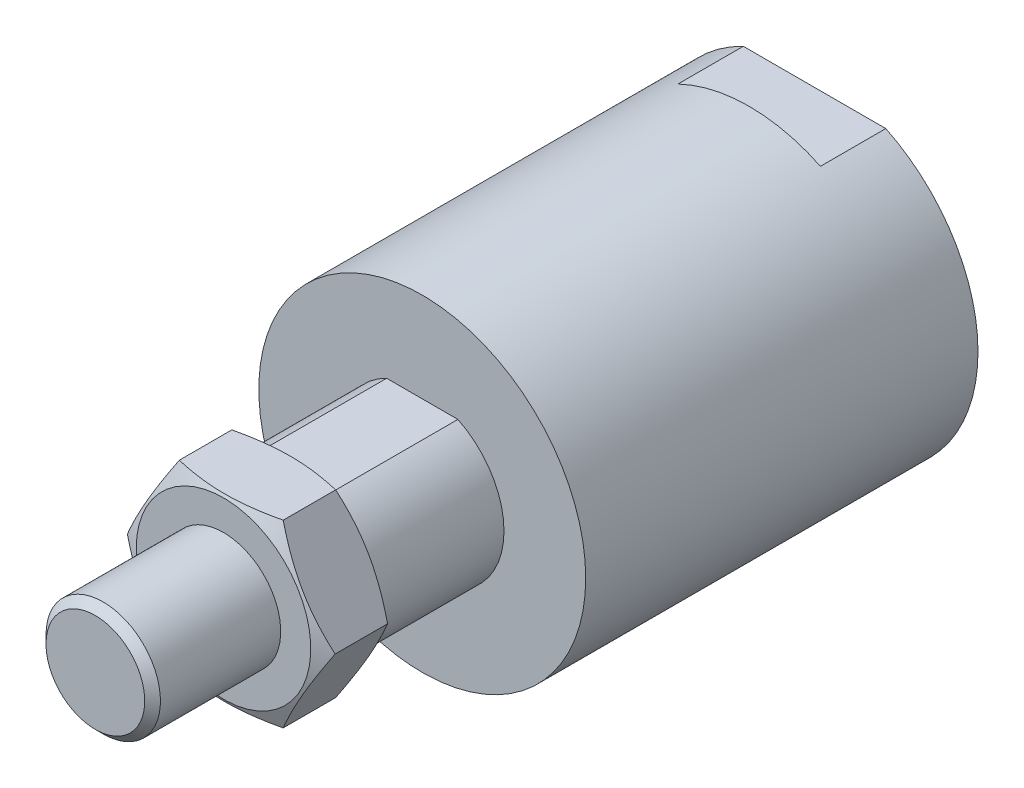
ISO-10303-21;
HEADER;
FILE_DESCRIPTION(('STEP AP214'),'2;1');
FILE_NAME('part.step','',(''),(''),'','','');
FILE_SCHEMA(('AUTOMOTIVE_DESIGN { 1 0 10303 214 1 1 1 1 }'));
ENDSEC;
DATA;
#1=APPLICATION_CONTEXT('core data for automotive mechanical design processes');
#2=APPLICATION_PROTOCOL_DEFINITION('international standard','automotive_design',2000,#1);
#3=PRODUCT_CONTEXT('',#1,'mechanical');
#4=PRODUCT('Part','Part','',(#3));
#5=PRODUCT_RELATED_PRODUCT_CATEGORY('part','',(#4));
#6=PRODUCT_DEFINITION_FORMATION('','',#4);
#7=PRODUCT_DEFINITION_CONTEXT('part definition',#1,'design');
#8=PRODUCT_DEFINITION('design','',#6,#7);
#9=PRODUCT_DEFINITION_SHAPE('','',#8);
#10=(LENGTH_UNIT() NAMED_UNIT(*) SI_UNIT(.MILLI.,.METRE.));
#11=(NAMED_UNIT(*) PLANE_ANGLE_UNIT() SI_UNIT($,.RADIAN.));
#12=(NAMED_UNIT(*) SI_UNIT($,.STERADIAN.) SOLID_ANGLE_UNIT());
#13=UNCERTAINTY_MEASURE_WITH_UNIT(LENGTH_MEASURE(1.E-05),#10,'distance_accuracy_value','');
#14=(GEOMETRIC_REPRESENTATION_CONTEXT(3) GLOBAL_UNCERTAINTY_ASSIGNED_CONTEXT((#13)) GLOBAL_UNIT_ASSIGNED_CONTEXT((#10,
#11,#12)) REPRESENTATION_CONTEXT('',''));
#15=CARTESIAN_POINT('',(0.,0.,0.));
#16=DIRECTION('',(0.,0.,1.));
#17=DIRECTION('',(1.,0.,0.));
#18=AXIS2_PLACEMENT_3D('',#15,#16,#17);
#19=CARTESIAN_POINT('',(0.00127583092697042,0.,12.4460057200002));
#20=DIRECTION('',(0.,0.,1.));
#21=DIRECTION('',(1.,-1.02068069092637E-11,0.));
#22=AXIS2_PLACEMENT_3D('',#19,#20,#21);
#23=CYLINDRICAL_SURFACE('',#22,5.55625);
#24=CARTESIAN_POINT('',(0.00127583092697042,0.,11.6840057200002));
#25=DIRECTION('',(0.,0.,-1.));
#26=DIRECTION('',(-1.,1.02068069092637E-11,0.));
#27=AXIS2_PLACEMENT_3D('',#24,#25,#26);
#28=CIRCLE('',#27,5.55625);
#29=CARTESIAN_POINT('',(-5.55497416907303,5.66917698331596E-11,11.6840057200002));
#30=VERTEX_POINT('',#29);
#31=EDGE_CURVE('E195',#30,#30,#28,.T.);
#32=ORIENTED_EDGE('',*,*,#31,.T.);
#33=EDGE_LOOP('',(#32));
#34=FACE_BOUND('',#33,.T.);
#35=CARTESIAN_POINT('',(0.00127583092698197,0.,0.));
#36=DIRECTION('',(0.,0.,1.));
#37=DIRECTION('',(-1.,0.,0.));
#38=AXIS2_PLACEMENT_3D('',#35,#36,#37);
#39=CIRCLE('',#38,5.5562451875);
#40=CARTESIAN_POINT('',(-5.55496935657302,0.,0.));
#41=VERTEX_POINT('',#40);
#42=EDGE_CURVE('E254',#41,#41,#39,.T.);
#43=ORIENTED_EDGE('',*,*,#42,.T.);
#44=EDGE_LOOP('',(#43));
#45=FACE_BOUND('',#44,.T.);
#46=ADVANCED_FACE('F15',(#34,#45),#23,.T.);
#47=CARTESIAN_POINT('',(0.00127583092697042,0.,12.4460057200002));
#48=DIRECTION('',(0.,0.,-1.));
#49=DIRECTION('',(-1.,1.02068069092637E-11,0.));
#50=AXIS2_PLACEMENT_3D('',#47,#48,#49);
#51=CONICAL_SURFACE('',#50,4.79425,0.785398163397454);
#52=ORIENTED_EDGE('',*,*,#31,.F.);
#53=EDGE_LOOP('',(#52));
#54=FACE_BOUND('',#53,.T.);
#55=CARTESIAN_POINT('',(0.00127583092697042,0.,12.4460057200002));
#56=DIRECTION('',(0.,0.,-1.));
#57=DIRECTION('',(-1.,1.02068069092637E-11,0.));
#58=AXIS2_PLACEMENT_3D('',#55,#56,#57);
#59=CIRCLE('',#58,4.79425);
#60=CARTESIAN_POINT('',(-4.79297416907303,4.89141829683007E-11,12.4460057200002));
#61=VERTEX_POINT('',#60);
#62=EDGE_CURVE('E192',#61,#61,#59,.F.);
#63=ORIENTED_EDGE('',*,*,#62,.F.);
#64=EDGE_LOOP('',(#63));
#65=FACE_BOUND('',#64,.T.);
#66=ADVANCED_FACE('F123',(#54,#65),#51,.T.);
#67=CARTESIAN_POINT('',(0.00127583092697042,0.,12.4460057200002));
#68=DIRECTION('',(0.,0.,-1.));
#69=DIRECTION('',(-1.,1.02068069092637E-11,0.));
#70=AXIS2_PLACEMENT_3D('',#67,#68,#69);
#71=PLANE('',#70);
#72=ORIENTED_EDGE('',*,*,#62,.T.);
#73=EDGE_LOOP('',(#72));
#74=FACE_BOUND('',#73,.T.);
#75=ADVANCED_FACE('F400',(#74),#71,.F.);
#76=CARTESIAN_POINT('',(-3.45860020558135,-7.14374999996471,-26.2691222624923));
#77=DIRECTION('',(1.02068069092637E-11,1.,0.));
#78=DIRECTION('',(0.,0.,1.));
#79=AXIS2_PLACEMENT_3D('',#76,#77,#78);
#80=PLANE('',#79);
#81=DIRECTION('',(0.,0.,1.));
#82=VECTOR('',#81,1.);
#83=CARTESIAN_POINT('',(3.46115186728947,-7.14375000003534,-26.2691222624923));
#84=LINE('',#83,#82);
#85=CARTESIAN_POINT('',(3.46115186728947,-7.14375000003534,-19.3039942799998));
#86=VERTEX_POINT('',#85);
#87=CARTESIAN_POINT('',(3.46115186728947,-7.14375000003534,-6.60399427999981));
#88=VERTEX_POINT('',#87);
#89=EDGE_CURVE('E148',#86,#88,#84,.T.);
#90=ORIENTED_EDGE('',*,*,#89,.T.);
#91=DIRECTION('',(1.,-1.02068069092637E-11,0.));
#92=VECTOR('',#91,1.);
#93=CARTESIAN_POINT('',(0.00127583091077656,-7.14375,-6.6039942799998));
#94=LINE('',#93,#92);
#95=CARTESIAN_POINT('',(-3.45860020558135,-7.14374999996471,-6.6039942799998));
#96=VERTEX_POINT('',#95);
#97=EDGE_CURVE('E19',#96,#88,#94,.T.);
#98=ORIENTED_EDGE('',*,*,#97,.F.);
#99=DIRECTION('',(0.,0.,1.));
#100=VECTOR('',#99,1.);
#101=CARTESIAN_POINT('',(-3.45860020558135,-7.14374999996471,-26.2691222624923));
#102=LINE('',#101,#100);
#103=CARTESIAN_POINT('',(-3.45860020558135,-7.14374999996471,-19.3039942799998));
#104=VERTEX_POINT('',#103);
#105=EDGE_CURVE('E145',#104,#96,#102,.T.);
#106=ORIENTED_EDGE('',*,*,#105,.F.);
#107=DIRECTION('',(-1.,1.02068069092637E-11,0.));
#108=VECTOR('',#107,1.);
#109=CARTESIAN_POINT('',(-3.45860020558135,-7.14374999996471,-19.3039942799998));
#110=LINE('',#109,#108);
#111=EDGE_CURVE('E142',#86,#104,#110,.T.);
#112=ORIENTED_EDGE('',*,*,#111,.F.);
#113=EDGE_LOOP('',(#90,#98,#106,#112));
#114=FACE_BOUND('',#113,.T.);
#115=ADVANCED_FACE('F393',(#114),#80,.F.);
#116=CARTESIAN_POINT('',(-3.45860020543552,7.1437500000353,-26.2691222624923));
#117=DIRECTION('',(-1.02068069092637E-11,-1.,0.));
#118=DIRECTION('',(0.,0.,-1.));
#119=AXIS2_PLACEMENT_3D('',#116,#117,#118);
#120=PLANE('',#119);
#121=DIRECTION('',(0.,0.,1.));
#122=VECTOR('',#121,1.);
#123=CARTESIAN_POINT('',(-3.45860020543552,7.1437500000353,-26.2691222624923));
#124=LINE('',#123,#122);
#125=CARTESIAN_POINT('',(-3.45860020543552,7.1437500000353,-19.3039942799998));
#126=VERTEX_POINT('',#125);
#127=CARTESIAN_POINT('',(-3.45860020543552,7.1437500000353,-6.60399427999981));
#128=VERTEX_POINT('',#127);
#129=EDGE_CURVE('E139',#126,#128,#124,.T.);
#130=ORIENTED_EDGE('',*,*,#129,.T.);
#131=DIRECTION('',(-1.,1.02068069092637E-11,0.));
#132=VECTOR('',#131,1.);
#133=CARTESIAN_POINT('',(0.00127583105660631,7.14375,-6.60399427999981));
#134=LINE('',#133,#132);
#135=CARTESIAN_POINT('',(3.46115186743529,7.14374999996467,-6.60399427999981));
#136=VERTEX_POINT('',#135);
#137=EDGE_CURVE('E719',#136,#128,#134,.T.);
#138=ORIENTED_EDGE('',*,*,#137,.F.);
#139=DIRECTION('',(0.,0.,1.));
#140=VECTOR('',#139,1.);
#141=CARTESIAN_POINT('',(3.46115186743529,7.14374999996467,-26.2691222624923));
#142=LINE('',#141,#140);
#143=CARTESIAN_POINT('',(3.46115186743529,7.14374999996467,-19.3039942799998));
#144=VERTEX_POINT('',#143);
#145=EDGE_CURVE('E136',#144,#136,#142,.T.);
#146=ORIENTED_EDGE('',*,*,#145,.F.);
#147=DIRECTION('',(1.,-1.02068069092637E-11,0.));
#148=VECTOR('',#147,1.);
#149=CARTESIAN_POINT('',(-3.45860020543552,7.1437500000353,-19.3039942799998));
#150=LINE('',#149,#148);
#151=EDGE_CURVE('E131',#126,#144,#150,.T.);
#152=ORIENTED_EDGE('',*,*,#151,.F.);
#153=EDGE_LOOP('',(#130,#138,#146,#152));
#154=FACE_BOUND('',#153,.T.);
#155=ADVANCED_FACE('F357',(#154),#120,.F.);
#156=CARTESIAN_POINT('',(0.00127583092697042,0.,12.4460057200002));
#157=DIRECTION('',(0.,0.,1.));
#158=DIRECTION('',(1.,-1.02068069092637E-11,0.));
#159=AXIS2_PLACEMENT_3D('',#156,#157,#158);
#160=CYLINDRICAL_SURFACE('',#159,7.9375);
#161=CARTESIAN_POINT('',(0.00127583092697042,0.,-6.6039942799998));
#162=DIRECTION('',(0.,0.,1.));
#163=DIRECTION('',(1.,-1.02068069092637E-11,0.));
#164=AXIS2_PLACEMENT_3D('',#161,#162,#163);
#165=CIRCLE('',#164,7.9375);
#166=EDGE_CURVE('E37',#128,#96,#165,.T.);
#167=ORIENTED_EDGE('',*,*,#166,.F.);
#168=ORIENTED_EDGE('',*,*,#129,.F.);
#169=CARTESIAN_POINT('',(0.00127583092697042,0.,-19.3039942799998));
#170=DIRECTION('',(0.,0.,1.));
#171=DIRECTION('',(1.,-1.02068069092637E-11,0.));
#172=AXIS2_PLACEMENT_3D('',#169,#170,#171);
#173=CIRCLE('',#172,7.9375);
#174=EDGE_CURVE('E180',#126,#104,#173,.T.);
#175=ORIENTED_EDGE('',*,*,#174,.T.);
#176=ORIENTED_EDGE('',*,*,#105,.T.);
#177=EDGE_LOOP('',(#167,#168,#175,#176));
#178=FACE_BOUND('',#177,.T.);
#179=ADVANCED_FACE('F347',(#178),#160,.T.);
#180=EDGE_CURVE('E182',#86,#144,#173,.T.);
#181=ORIENTED_EDGE('',*,*,#180,.T.);
#182=ORIENTED_EDGE('',*,*,#145,.T.);
#183=EDGE_CURVE('E25',#88,#136,#165,.T.);
#184=ORIENTED_EDGE('',*,*,#183,.F.);
#185=ORIENTED_EDGE('',*,*,#89,.F.);
#186=EDGE_LOOP('',(#181,#182,#184,#185));
#187=FACE_BOUND('',#186,.T.);
#188=ADVANCED_FACE('F341',(#187),#160,.T.);
#189=CARTESIAN_POINT('',(0.00127583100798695,7.9375,-19.3039942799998));
#190=DIRECTION('',(0.,0.,-1.));
#191=DIRECTION('',(-1.,1.02068069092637E-11,0.));
#192=AXIS2_PLACEMENT_3D('',#189,#190,#191);
#193=PLANE('',#192);
#194=ORIENTED_EDGE('',*,*,#180,.F.);
#195=ORIENTED_EDGE('',*,*,#111,.T.);
#196=ORIENTED_EDGE('',*,*,#174,.F.);
#197=ORIENTED_EDGE('',*,*,#151,.T.);
#198=EDGE_LOOP('',(#194,#195,#196,#197));
#199=FACE_BOUND('',#198,.T.);
#200=CARTESIAN_POINT('',(0.00127583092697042,0.,-19.3039942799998));
#201=DIRECTION('',(0.,0.,1.));
#202=DIRECTION('',(1.,-1.02068069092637E-11,0.));
#203=AXIS2_PLACEMENT_3D('',#200,#201,#202);
#204=CIRCLE('',#203,15.875);
#205=CARTESIAN_POINT('',(15.876275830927,-1.62052860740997E-10,-19.3039942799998));
#206=VERTEX_POINT('',#205);
#207=EDGE_CURVE('E185',#206,#206,#204,.T.);
#208=ORIENTED_EDGE('',*,*,#207,.T.);
#209=EDGE_LOOP('',(#208));
#210=FACE_BOUND('',#209,.T.);
#211=ADVANCED_FACE('F346',(#199,#210),#193,.F.);
#212=CARTESIAN_POINT('',(0.00127583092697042,0.,12.4460057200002));
#213=DIRECTION('',(0.,0.,1.));
#214=DIRECTION('',(1.,-1.02068069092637E-11,0.));
#215=AXIS2_PLACEMENT_3D('',#212,#213,#214);
#216=CYLINDRICAL_SURFACE('',#215,15.875);
#217=CARTESIAN_POINT('',(0.00127583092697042,0.,-57.4039942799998));
#218=DIRECTION('',(0.,0.,1.));
#219=DIRECTION('',(1.,-1.02068069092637E-11,0.));
#220=AXIS2_PLACEMENT_3D('',#217,#218,#219);
#221=CIRCLE('',#220,15.875);
#222=CARTESIAN_POINT('',(6.92102790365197,-14.2875000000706,-57.4039942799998));
#223=VERTEX_POINT('',#222);
#224=CARTESIAN_POINT('',(6.92102790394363,14.2874999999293,-57.4039942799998));
#225=VERTEX_POINT('',#224);
#226=EDGE_CURVE('E189',#223,#225,#221,.T.);
#227=ORIENTED_EDGE('',*,*,#226,.T.);
#228=DIRECTION('',(0.,0.,-1.));
#229=VECTOR('',#228,1.);
#230=CARTESIAN_POINT('',(6.92102790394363,14.2874999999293,-51.0539942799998));
#231=LINE('',#230,#229);
#232=CARTESIAN_POINT('',(6.92102790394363,14.2874999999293,-51.0539942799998));
#233=VERTEX_POINT('',#232);
#234=EDGE_CURVE('E157',#233,#225,#231,.T.);
#235=ORIENTED_EDGE('',*,*,#234,.F.);
#236=CARTESIAN_POINT('',(0.00127583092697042,0.,-51.0539942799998));
#237=DIRECTION('',(0.,0.,-1.));
#238=DIRECTION('',(-1.,1.02068069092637E-11,0.));
#239=AXIS2_PLACEMENT_3D('',#236,#237,#238);
#240=CIRCLE('',#239,15.875);
#241=CARTESIAN_POINT('',(-6.91847624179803,14.2875000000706,-51.0539942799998));
#242=VERTEX_POINT('',#241);
#243=EDGE_CURVE('E153',#242,#233,#240,.T.);
#244=ORIENTED_EDGE('',*,*,#243,.F.);
#245=DIRECTION('',(0.,0.,-1.));
#246=VECTOR('',#245,1.);
#247=CARTESIAN_POINT('',(-6.91847624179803,14.2875000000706,-51.0539942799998));
#248=LINE('',#247,#246);
#249=CARTESIAN_POINT('',(-6.91847624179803,14.2875000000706,-57.4039942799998));
#250=VERTEX_POINT('',#249);
#251=EDGE_CURVE('E158',#242,#250,#248,.T.);
#252=ORIENTED_EDGE('',*,*,#251,.T.);
#253=CARTESIAN_POINT('',(-6.91847624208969,-14.2874999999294,-57.4039942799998));
#254=VERTEX_POINT('',#253);
#255=EDGE_CURVE('E188',#250,#254,#221,.T.);
#256=ORIENTED_EDGE('',*,*,#255,.T.);
#257=DIRECTION('',(0.,0.,-1.));
#258=VECTOR('',#257,1.);
#259=CARTESIAN_POINT('',(-6.91847624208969,-14.2874999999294,-51.0539942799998));
#260=LINE('',#259,#258);
#261=CARTESIAN_POINT('',(-6.91847624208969,-14.2874999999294,-51.0539942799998));
#262=VERTEX_POINT('',#261);
#263=EDGE_CURVE('E168',#262,#254,#260,.T.);
#264=ORIENTED_EDGE('',*,*,#263,.F.);
#265=CARTESIAN_POINT('',(0.00127583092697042,0.,-51.0539942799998));
#266=DIRECTION('',(0.,0.,-1.));
#267=DIRECTION('',(-1.,1.02068069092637E-11,0.));
#268=AXIS2_PLACEMENT_3D('',#265,#266,#267);
#269=CIRCLE('',#268,15.875);
#270=CARTESIAN_POINT('',(6.92102790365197,-14.2875000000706,-51.0539942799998));
#271=VERTEX_POINT('',#270);
#272=EDGE_CURVE('E164',#271,#262,#269,.T.);
#273=ORIENTED_EDGE('',*,*,#272,.F.);
#274=DIRECTION('',(0.,0.,-1.));
#275=VECTOR('',#274,1.);
#276=CARTESIAN_POINT('',(6.92102790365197,-14.2875000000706,-51.0539942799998));
#277=LINE('',#276,#275);
#278=EDGE_CURVE('E169',#271,#223,#277,.T.);
#279=ORIENTED_EDGE('',*,*,#278,.T.);
#280=EDGE_LOOP('',(#227,#235,#244,#252,#256,#264,#273,#279));
#281=FACE_BOUND('',#280,.T.);
#282=ORIENTED_EDGE('',*,*,#207,.F.);
#283=EDGE_LOOP('',(#282));
#284=FACE_BOUND('',#283,.T.);
#285=ADVANCED_FACE('F354',(#281,#284),#216,.T.);
#286=CARTESIAN_POINT('',(0.00127583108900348,15.875,-57.4039942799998));
#287=DIRECTION('',(0.,0.,1.));
#288=DIRECTION('',(1.,-1.02068069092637E-11,0.));
#289=AXIS2_PLACEMENT_3D('',#286,#287,#288);
#290=PLANE('',#289);
#291=CARTESIAN_POINT('',(0.00127583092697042,0.,-57.4039942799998));
#292=DIRECTION('',(0.,0.,-1.));
#293=DIRECTION('',(-1.,1.02068069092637E-11,0.));
#294=AXIS2_PLACEMENT_3D('',#291,#292,#293);
#295=CIRCLE('',#294,4.96062);
#296=CARTESIAN_POINT('',(-4.95934416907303,5.06122894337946E-11,-57.4039942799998));
#297=VERTEX_POINT('',#296);
#298=EDGE_CURVE('E128',#297,#297,#295,.T.);
#299=ORIENTED_EDGE('',*,*,#298,.F.);
#300=EDGE_LOOP('',(#299));
#301=FACE_BOUND('',#300,.T.);
#302=ORIENTED_EDGE('',*,*,#255,.F.);
#303=DIRECTION('',(-1.,1.02068069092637E-11,0.));
#304=VECTOR('',#303,1.);
#305=CARTESIAN_POINT('',(6.92102790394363,14.2874999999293,-57.4039942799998));
#306=LINE('',#305,#304);
#307=EDGE_CURVE('E151',#225,#250,#306,.T.);
#308=ORIENTED_EDGE('',*,*,#307,.F.);
#309=ORIENTED_EDGE('',*,*,#226,.F.);
#310=DIRECTION('',(1.,-1.02068069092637E-11,0.));
#311=VECTOR('',#310,1.);
#312=CARTESIAN_POINT('',(6.92102790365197,-14.2875000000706,-57.4039942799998));
#313=LINE('',#312,#311);
#314=EDGE_CURVE('E161',#254,#223,#313,.T.);
#315=ORIENTED_EDGE('',*,*,#314,.F.);
#316=EDGE_LOOP('',(#302,#308,#309,#315));
#317=FACE_BOUND('',#316,.T.);
#318=ADVANCED_FACE('F240',(#301,#317),#290,.F.);
#319=CARTESIAN_POINT('',(6.92102790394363,14.2874999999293,-51.0539942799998));
#320=DIRECTION('',(-1.02068069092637E-11,-1.,0.));
#321=DIRECTION('',(0.,0.,-1.));
#322=AXIS2_PLACEMENT_3D('',#319,#320,#321);
#323=PLANE('',#322);
#324=ORIENTED_EDGE('',*,*,#307,.T.);
#325=ORIENTED_EDGE('',*,*,#251,.F.);
#326=DIRECTION('',(-1.,1.02068069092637E-11,0.));
#327=VECTOR('',#326,1.);
#328=CARTESIAN_POINT('',(6.92102790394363,14.2874999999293,-51.0539942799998));
#329=LINE('',#328,#327);
#330=EDGE_CURVE('E155',#233,#242,#329,.T.);
#331=ORIENTED_EDGE('',*,*,#330,.F.);
#332=ORIENTED_EDGE('',*,*,#234,.T.);
#333=EDGE_LOOP('',(#324,#325,#331,#332));
#334=FACE_BOUND('',#333,.T.);
#335=ADVANCED_FACE('F362',(#334),#323,.F.);
#336=CARTESIAN_POINT('',(0.00127583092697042,0.,-51.0539942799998));
#337=DIRECTION('',(0.,0.,-1.));
#338=DIRECTION('',(-1.,1.02068069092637E-11,0.));
#339=AXIS2_PLACEMENT_3D('',#336,#337,#338);
#340=PLANE('',#339);
#341=ORIENTED_EDGE('',*,*,#243,.T.);
#342=ORIENTED_EDGE('',*,*,#330,.T.);
#343=EDGE_LOOP('',(#341,#342));
#344=FACE_BOUND('',#343,.T.);
#345=ADVANCED_FACE('F368',(#344),#340,.T.);
#346=CARTESIAN_POINT('',(6.92102790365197,-14.2875000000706,-51.0539942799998));
#347=DIRECTION('',(1.02068069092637E-11,1.,0.));
#348=DIRECTION('',(0.,0.,1.));
#349=AXIS2_PLACEMENT_3D('',#346,#347,#348);
#350=PLANE('',#349);
#351=ORIENTED_EDGE('',*,*,#314,.T.);
#352=ORIENTED_EDGE('',*,*,#278,.F.);
#353=DIRECTION('',(1.,-1.02068069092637E-11,0.));
#354=VECTOR('',#353,1.);
#355=CARTESIAN_POINT('',(6.92102790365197,-14.2875000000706,-51.0539942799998));
#356=LINE('',#355,#354);
#357=EDGE_CURVE('E166',#262,#271,#356,.T.);
#358=ORIENTED_EDGE('',*,*,#357,.F.);
#359=ORIENTED_EDGE('',*,*,#263,.T.);
#360=EDGE_LOOP('',(#351,#352,#358,#359));
#361=FACE_BOUND('',#360,.T.);
#362=ADVANCED_FACE('F359',(#361),#350,.F.);
#363=CARTESIAN_POINT('',(0.00127583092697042,0.,-51.0539942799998));
#364=DIRECTION('',(0.,0.,-1.));
#365=DIRECTION('',(-1.,1.02068069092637E-11,0.));
#366=AXIS2_PLACEMENT_3D('',#363,#364,#365);
#367=PLANE('',#366);
#368=ORIENTED_EDGE('',*,*,#272,.T.);
#369=ORIENTED_EDGE('',*,*,#357,.T.);
#370=EDGE_LOOP('',(#368,#369));
#371=FACE_BOUND('',#370,.T.);
#372=ADVANCED_FACE('F371',(#371),#367,.T.);
#373=CARTESIAN_POINT('',(0.00127583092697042,0.,-57.4039942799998));
#374=DIRECTION('',(0.,0.,-1.));
#375=DIRECTION('',(-1.,1.02068069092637E-11,0.));
#376=AXIS2_PLACEMENT_3D('',#373,#374,#375);
#377=CYLINDRICAL_SURFACE('',#376,4.96062);
#378=CARTESIAN_POINT('',(0.00127583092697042,0.,-32.0039942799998));
#379=DIRECTION('',(0.,0.,-1.));
#380=DIRECTION('',(-1.,1.02068069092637E-11,0.));
#381=AXIS2_PLACEMENT_3D('',#378,#379,#380);
#382=CIRCLE('',#381,4.96062);
#383=CARTESIAN_POINT('',(-4.95934416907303,5.06122894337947E-11,-32.0039942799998));
#384=VERTEX_POINT('',#383);
#385=EDGE_CURVE('E126',#384,#384,#382,.T.);
#386=ORIENTED_EDGE('',*,*,#385,.F.);
#387=EDGE_LOOP('',(#386));
#388=FACE_BOUND('',#387,.T.);
#389=ORIENTED_EDGE('',*,*,#298,.T.);
#390=EDGE_LOOP('',(#389));
#391=FACE_BOUND('',#390,.T.);
#392=ADVANCED_FACE('F121',(#388,#391),#377,.F.);
#393=CARTESIAN_POINT('',(0.00127583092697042,0.,-32.0039942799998));
#394=DIRECTION('',(0.,0.,-1.));
#395=DIRECTION('',(-1.,1.02068069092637E-11,0.));
#396=AXIS2_PLACEMENT_3D('',#393,#394,#395);
#397=CONICAL_SURFACE('',#396,4.96062,1.02974425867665);
#398=CARTESIAN_POINT('',(0.00127583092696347,0.,-29.0233530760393));
#399=VERTEX_POINT('',#398);
#400=VERTEX_LOOP('',#399);
#401=FACE_BOUND('',#400,.T.);
#402=ORIENTED_EDGE('',*,*,#385,.T.);
#403=EDGE_LOOP('',(#402));
#404=FACE_BOUND('',#403,.T.);
#405=ADVANCED_FACE('F118',(#401,#404),#397,.F.);
#406=CARTESIAN_POINT('',(0.00127583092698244,-8.47501425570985,0.));
#407=DIRECTION('',(0.,0.,1.));
#408=DIRECTION('',(-1.,0.,0.));
#409=AXIS2_PLACEMENT_3D('',#406,#407,#408);
#410=PLANE('',#409);
#411=CARTESIAN_POINT('',(0.00127583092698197,0.,0.));
#412=DIRECTION('',(0.,0.,1.));
#413=DIRECTION('',(-1.,0.,0.));
#414=AXIS2_PLACEMENT_3D('',#411,#412,#413);
#415=CIRCLE('',#414,8.47501425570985);
#416=CARTESIAN_POINT('',(-8.47373842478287,0.,0.));
#417=VERTEX_POINT('',#416);
#418=EDGE_CURVE('E326',#417,#417,#415,.T.);
#419=ORIENTED_EDGE('',*,*,#418,.T.);
#420=EDGE_LOOP('',(#419));
#421=FACE_BOUND('',#420,.T.);
#422=ORIENTED_EDGE('',*,*,#42,.F.);
#423=EDGE_LOOP('',(#422));
#424=FACE_BOUND('',#423,.T.);
#425=ADVANCED_FACE('F17',(#421,#424),#410,.T.);
#426=CARTESIAN_POINT('',(0.00127583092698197,0.,0.));
#427=DIRECTION('',(0.,0.,-1.));
#428=DIRECTION('',(1.,0.,0.));
#429=AXIS2_PLACEMENT_3D('',#426,#427,#428);
#430=CONICAL_SURFACE('',#429,8.47501425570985,1.1344640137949);
#431=CARTESIAN_POINT('',(-13.3571385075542,-8.73759243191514,-3.49134558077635));
#432=CARTESIAN_POINT('',(-12.9645939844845,-8.73759243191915,-3.33820287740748));
#433=CARTESIAN_POINT('',(-12.5713827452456,-8.73759243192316,-3.18673739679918));
#434=CARTESIAN_POINT('',(-11.7832732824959,-8.73759243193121,-2.88811234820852));
#435=CARTESIAN_POINT('',(-11.3883748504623,-8.73759243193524,-2.74095333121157));
#436=CARTESIAN_POINT('',(-10.5952915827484,-8.73759243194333,-2.45144093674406));
#437=CARTESIAN_POINT('',(-10.1971001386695,-8.73759243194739,-2.30910559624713));
#438=CARTESIAN_POINT('',(-9.39839628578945,-8.73759243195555,-2.03112193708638));
#439=CARTESIAN_POINT('',(-8.99788395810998,-8.73759243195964,-1.89547338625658));
#440=CARTESIAN_POINT('',(-8.19946388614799,-8.73759243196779,-1.63435022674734));
#441=CARTESIAN_POINT('',(-7.80159287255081,-8.73759243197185,-1.50876387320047));
#442=CARTESIAN_POINT('',(-7.00268670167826,-8.73759243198,-1.26793542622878));
#443=CARTESIAN_POINT('',(-6.60165138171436,-8.73759243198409,-1.15269386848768));
#444=CARTESIAN_POINT('',(-5.79641918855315,-8.73759243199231,-0.935400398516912));
#445=CARTESIAN_POINT('',(-5.39222583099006,-8.73759243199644,-0.833335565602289));
#446=CARTESIAN_POINT('',(-4.58004491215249,-8.73759243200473,-0.645596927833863));
#447=CARTESIAN_POINT('',(-4.17205788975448,-8.7375924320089,-0.559920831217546));
#448=CARTESIAN_POINT('',(-3.48231601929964,-8.73759243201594,-0.432689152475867));
#449=CARTESIAN_POINT('',(-3.20155313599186,-8.7375924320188,-0.385757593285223));
#450=CARTESIAN_POINT('',(-2.63844864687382,-8.73759243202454,-0.302499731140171));
#451=CARTESIAN_POINT('',(-2.3561070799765,-8.73759243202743,-0.266173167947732));
#452=CARTESIAN_POINT('',(-1.79028667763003,-8.7375924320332,-0.205228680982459));
#453=CARTESIAN_POINT('',(-1.50680844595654,-8.7375924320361,-0.180605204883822));
#454=CARTESIAN_POINT('',(-0.939035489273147,-8.73759243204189,-0.143870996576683));
#455=CARTESIAN_POINT('',(-0.654740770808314,-8.73759243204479,-0.131760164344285));
#456=CARTESIAN_POINT('',(-0.0846729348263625,-8.73759243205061,-0.120465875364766));
#457=CARTESIAN_POINT('',(0.201101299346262,-8.73759243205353,-0.121338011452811));
#458=CARTESIAN_POINT('',(0.772311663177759,-8.73759243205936,-0.136112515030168));
#459=CARTESIAN_POINT('',(1.05774778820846,-8.73759243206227,-0.150015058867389));
#460=CARTESIAN_POINT('',(1.62777643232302,-8.73759243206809,-0.190350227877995));
#461=CARTESIAN_POINT('',(1.91236879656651,-8.73759243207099,-0.216785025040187));
#462=CARTESIAN_POINT('',(2.48019600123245,-8.73759243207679,-0.281295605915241));
#463=CARTESIAN_POINT('',(2.76343088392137,-8.73759243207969,-0.319371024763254));
#464=CARTESIAN_POINT('',(3.81148840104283,-8.73759243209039,-0.480178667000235));
#465=CARTESIAN_POINT('',(4.57128897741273,-8.73759243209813,-0.636306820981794));
#466=CARTESIAN_POINT('',(5.70102270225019,-8.73759243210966,-0.910374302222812));
#467=CARTESIAN_POINT('',(6.07617839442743,-8.73759243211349,-1.00845222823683));
#468=CARTESIAN_POINT('',(6.8235187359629,-8.73759243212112,-1.21539312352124));
#469=CARTESIAN_POINT('',(7.19570357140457,-8.73759243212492,-1.32425541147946));
#470=CARTESIAN_POINT('',(7.9394537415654,-8.73759243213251,-1.55127057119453));
#471=CARTESIAN_POINT('',(8.31100418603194,-8.7375924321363,-1.66947163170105));
#472=CARTESIAN_POINT('',(9.05178701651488,-8.73759243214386,-1.91292315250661));
#473=CARTESIAN_POINT('',(9.42101937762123,-8.73759243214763,-2.03817368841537));
#474=CARTESIAN_POINT('',(10.1573145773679,-8.73759243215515,-2.29430640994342));
#475=CARTESIAN_POINT('',(10.5243783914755,-8.7375924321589,-2.42518580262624));
#476=CARTESIAN_POINT('',(11.2568159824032,-8.73759243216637,-2.69157342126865));
#477=CARTESIAN_POINT('',(11.6221897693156,-8.7375924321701,-2.82708161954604));
#478=CARTESIAN_POINT('',(12.3528245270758,-8.73759243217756,-3.1023906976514));
#479=CARTESIAN_POINT('',(12.7180803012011,-8.73759243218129,-3.24220534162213));
#480=CARTESIAN_POINT('',(13.4473661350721,-8.73759243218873,-3.52499894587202));
#481=CARTESIAN_POINT('',(13.8113961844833,-8.73759243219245,-3.66797793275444));
#482=CARTESIAN_POINT('',(14.9020133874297,-8.73759243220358,-4.10087665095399));
#483=CARTESIAN_POINT('',(15.6270407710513,-8.73759243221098,-4.39472511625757));
#484=CARTESIAN_POINT('',(17.0647785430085,-8.73759243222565,-4.98602171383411));
#485=CARTESIAN_POINT('',(17.7775278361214,-8.73759243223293,-5.2833756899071));
#486=CARTESIAN_POINT('',(18.8448846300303,-8.73759243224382,-5.73337230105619));
#487=CARTESIAN_POINT('',(19.2003370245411,-8.73759243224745,-5.88401546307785));
#488=CARTESIAN_POINT('',(19.9107443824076,-8.7375924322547,-6.18646450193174));
#489=CARTESIAN_POINT('',(20.2656993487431,-8.73759243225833,-6.33827037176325));
#490=CARTESIAN_POINT('',(20.620440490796,-8.73759243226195,-6.4905737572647));
#491=B_SPLINE_CURVE_WITH_KNOTS('',3,(#431,#432,#433,#434,#435,#436,#437,#438,#439,#440,#441,
#442,#443,#444,#445,#446,#447,#448,#449,#450,#451,#452,#453,#454,#455,#456,#457,#458,#459,#460,
#461,#462,#463,#464,#465,#466,#467,#468,#469,#470,#471,#472,#473,#474,#475,#476,#477,#478,#479,
#480,#481,#482,#483,#484,#485,#486,#487,#488,#489,#490),.UNSPECIFIED.,.F.,.F.,(4,2,2,2,2,2,2,2,
2,2,2,2,2,2,2,2,2,2,2,2,2,2,2,2,2,2,2,2,2,4),(0.,1.26409214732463,2.52834532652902,
3.79689623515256,5.06540306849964,6.31695628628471,7.56857427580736,8.81895549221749,
10.0691617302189,10.9229642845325,11.7767458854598,12.6301220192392,13.4834913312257,
14.3405158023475,15.1975518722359,16.0547365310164,16.9118943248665,19.2353724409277,
20.3986144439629,21.561783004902,22.7314041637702,23.9010378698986,25.0700977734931,
26.2391506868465,27.4124357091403,28.5857305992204,30.9325990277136,33.249440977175,
34.4076092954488,35.5657706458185),.UNSPECIFIED.);
#492=CARTESIAN_POINT('',(5.04592717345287,-8.73759243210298,-0.752755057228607));
#493=VERTEX_POINT('',#492);
#494=CARTESIAN_POINT('',(-5.04337551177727,-8.737592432,-0.752755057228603));
#495=VERTEX_POINT('',#494);
#496=EDGE_CURVE('E294',#493,#495,#491,.F.);
#497=ORIENTED_EDGE('',*,*,#496,.F.);
#498=CARTESIAN_POINT('',(10.0906939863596,0.000199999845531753,-0.75280890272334));
#499=CARTESIAN_POINT('',(9.93813490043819,-0.264040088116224,-0.681670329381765));
#500=CARTESIAN_POINT('',(9.78501290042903,-0.529255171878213,-0.615100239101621));
#501=CARTESIAN_POINT('',(9.47761984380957,-1.0616755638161,-0.492682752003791));
#502=CARTESIAN_POINT('',(9.32334821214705,-1.32888186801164,-0.436841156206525));
#503=CARTESIAN_POINT('',(9.01365236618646,-1.86529080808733,-0.337500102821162));
#504=CARTESIAN_POINT('',(8.85822720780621,-2.13449507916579,-0.29401225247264));
#505=CARTESIAN_POINT('',(8.54658009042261,-2.67428372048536,-0.22098394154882));
#506=CARTESIAN_POINT('',(8.39035828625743,-2.94486782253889,-0.191440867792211));
#507=CARTESIAN_POINT('',(8.08062208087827,-3.48134666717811,-0.147934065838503));
#508=CARTESIAN_POINT('',(7.92711870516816,-3.74722231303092,-0.133660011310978));
#509=CARTESIAN_POINT('',(7.61993492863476,-4.27928022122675,-0.12021461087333));
#510=CARTESIAN_POINT('',(7.46625451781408,-4.54546250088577,-0.121044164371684));
#511=CARTESIAN_POINT('',(7.15924550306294,-5.07721771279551,-0.137764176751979));
#512=CARTESIAN_POINT('',(7.00591670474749,-5.34279098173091,-0.153640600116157));
#513=CARTESIAN_POINT('',(6.69981938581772,-5.87296709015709,-0.19977081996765));
#514=CARTESIAN_POINT('',(6.54705081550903,-6.13757001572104,-0.23002330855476));
#515=CARTESIAN_POINT('',(6.28169234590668,-6.59718436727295,-0.294221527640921));
#516=CARTESIAN_POINT('',(6.16891850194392,-6.7925143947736,-0.325194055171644));
#517=CARTESIAN_POINT('',(5.94388634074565,-7.18228153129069,-0.393827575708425));
#518=CARTESIAN_POINT('',(5.83162800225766,-7.37671867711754,-0.431488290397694));
#519=CARTESIAN_POINT('',(5.60675955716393,-7.76620224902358,-0.513210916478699));
#520=CARTESIAN_POINT('',(5.49415397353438,-7.96124084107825,-0.557322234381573));
#521=CARTESIAN_POINT('',(5.26953819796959,-8.35028677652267,-0.651075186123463));
#522=CARTESIAN_POINT('',(5.15752790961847,-8.54429428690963,-0.700715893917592));
#523=CARTESIAN_POINT('',(5.04581170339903,-8.73779243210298,-0.752808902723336));
#524=B_SPLINE_CURVE_WITH_KNOTS('',3,(#498,#499,#500,#501,#502,#503,#504,#505,#506,#507,#508,
#509,#510,#511,#512,#513,#514,#515,#516,#517,#518,#519,#520,#521,#522,#523),.UNSPECIFIED.,.F.,
.F.,(4,2,2,2,2,2,2,2,2,2,2,2,4),(0.,0.939957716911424,1.8804222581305,2.82176753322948,
3.76293633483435,4.68459063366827,5.60629981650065,6.52715008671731,7.44791659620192,
8.13080975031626,8.81367449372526,9.50207371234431,10.1903578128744),.UNSPECIFIED.);
#525=CARTESIAN_POINT('',(10.0905785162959,-1.71628802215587E-10,-0.752755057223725));
#526=VERTEX_POINT('',#525);
#527=EDGE_CURVE('E246',#526,#493,#524,.T.);
#528=ORIENTED_EDGE('',*,*,#527,.F.);
#529=CARTESIAN_POINT('',(5.04581170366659,8.73779243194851,-0.75280890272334));
#530=CARTESIAN_POINT('',(5.1983707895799,8.47355234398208,-0.68167032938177));
#531=CARTESIAN_POINT('',(5.35149278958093,8.2083372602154,-0.615100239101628));
#532=CARTESIAN_POINT('',(5.65888584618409,7.6759168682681,-0.492682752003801));
#533=CARTESIAN_POINT('',(5.81315747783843,7.40871056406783,-0.436841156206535));
#534=CARTESIAN_POINT('',(6.12285332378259,6.87230162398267,-0.337500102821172));
#535=CARTESIAN_POINT('',(6.2782784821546,6.60309735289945,-0.29401225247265));
#536=CARTESIAN_POINT('',(6.58992559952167,6.06330871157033,-0.220983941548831));
#537=CARTESIAN_POINT('',(6.74614740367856,5.79272460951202,-0.191440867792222));
#538=CARTESIAN_POINT('',(7.05588360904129,5.25624576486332,-0.147934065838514));
#539=CARTESIAN_POINT('',(7.20938698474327,4.9903701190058,-0.133660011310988));
#540=CARTESIAN_POINT('',(7.51657076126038,4.45831221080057,-0.12021461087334));
#541=CARTESIAN_POINT('',(7.6702511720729,4.19212993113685,-0.121044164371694));
#542=CARTESIAN_POINT('',(7.97726018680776,3.66037471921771,-0.137764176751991));
#543=CARTESIAN_POINT('',(8.13058898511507,3.39480145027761,-0.153640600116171));
#544=CARTESIAN_POINT('',(8.43668630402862,2.86462534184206,-0.199770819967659));
#545=CARTESIAN_POINT('',(8.58945487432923,2.60002241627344,-0.230023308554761));
#546=CARTESIAN_POINT('',(8.85481334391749,2.1404080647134,-0.294221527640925));
#547=CARTESIAN_POINT('',(8.96758718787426,1.9450780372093,-0.325194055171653));
#548=CARTESIAN_POINT('',(9.19261934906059,1.55531090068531,-0.393827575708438));
#549=CARTESIAN_POINT('',(9.30487768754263,1.36087375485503,-0.431488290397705));
#550=CARTESIAN_POINT('',(9.52974613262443,0.971390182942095,-0.513210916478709));
#551=CARTESIAN_POINT('',(9.64235171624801,0.776351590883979,-0.557322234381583));
#552=CARTESIAN_POINT('',(9.86696749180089,0.387305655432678,-0.651075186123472));
#553=CARTESIAN_POINT('',(9.97897778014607,0.19329814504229,-0.7007158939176));
#554=CARTESIAN_POINT('',(10.0906939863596,-0.000200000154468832,-0.75280890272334));
#555=B_SPLINE_CURVE_WITH_KNOTS('',3,(#529,#530,#531,#532,#533,#534,#535,#536,#537,#538,#539,
#540,#541,#542,#543,#544,#545,#546,#547,#548,#549,#550,#551,#552,#553,#554),.UNSPECIFIED.,.F.,
.F.,(4,2,2,2,2,2,2,2,2,2,2,2,4),(0.,0.939957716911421,1.8804222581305,2.82176753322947,
3.76293633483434,4.68459063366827,5.60629981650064,6.5271500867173,7.44791659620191,
8.13080975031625,8.81367449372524,9.50207371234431,10.1903578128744),.UNSPECIFIED.);
#556=CARTESIAN_POINT('',(5.04592717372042,8.73759243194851,-0.75275505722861));
#557=VERTEX_POINT('',#556);
#558=EDGE_CURVE('E253',#557,#526,#555,.T.);
#559=ORIENTED_EDGE('',*,*,#558,.F.);
#560=CARTESIAN_POINT('',(-13.3571385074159,8.73759243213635,-3.49134558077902));
#561=CARTESIAN_POINT('',(-12.9645939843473,8.73759243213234,-3.33820287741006));
#562=CARTESIAN_POINT('',(-12.5713827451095,8.73759243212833,-3.1867373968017));
#563=CARTESIAN_POINT('',(-11.7832732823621,8.73759243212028,-2.88811234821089));
#564=CARTESIAN_POINT('',(-11.3883748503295,8.73759243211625,-2.74095333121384));
#565=CARTESIAN_POINT('',(-10.5952915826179,8.73759243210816,-2.45144093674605));
#566=CARTESIAN_POINT('',(-10.1971001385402,8.73759243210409,-2.30910559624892));
#567=CARTESIAN_POINT('',(-9.39839628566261,8.73759243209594,-2.03112193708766));
#568=CARTESIAN_POINT('',(-8.99788395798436,8.73759243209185,-1.89547338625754));
#569=CARTESIAN_POINT('',(-8.19946388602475,8.73759243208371,-1.63435022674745));
#570=CARTESIAN_POINT('',(-7.80159287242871,8.73759243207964,-1.50876387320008));
#571=CARTESIAN_POINT('',(-7.00268670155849,8.73759243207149,-1.26793542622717));
#572=CARTESIAN_POINT('',(-6.60165138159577,8.73759243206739,-1.15269386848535));
#573=CARTESIAN_POINT('',(-5.79641918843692,8.73759243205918,-0.935400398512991));
#574=CARTESIAN_POINT('',(-5.39222583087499,8.73759243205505,-0.833335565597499));
#575=CARTESIAN_POINT('',(-4.58004491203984,8.73759243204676,-0.645596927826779));
#576=CARTESIAN_POINT('',(-4.17205788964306,8.73759243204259,-0.559920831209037));
#577=CARTESIAN_POINT('',(-3.48231601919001,8.73759243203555,-0.432689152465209));
#578=CARTESIAN_POINT('',(-3.20155313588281,8.73759243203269,-0.385757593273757));
#579=CARTESIAN_POINT('',(-2.63844864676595,8.73759243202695,-0.302499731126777));
#580=CARTESIAN_POINT('',(-2.35610707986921,8.73759243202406,-0.266173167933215));
#581=CARTESIAN_POINT('',(-1.79028667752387,8.73759243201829,-0.205228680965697));
#582=CARTESIAN_POINT('',(-1.50680844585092,8.73759243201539,-0.180605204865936));
#583=CARTESIAN_POINT('',(-0.939035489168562,8.7375924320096,-0.143870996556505));
#584=CARTESIAN_POINT('',(-0.654740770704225,8.73759243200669,-0.131760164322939));
#585=CARTESIAN_POINT('',(-0.0846729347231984,8.73759243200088,-0.1204658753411));
#586=CARTESIAN_POINT('',(0.201101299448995,8.73759243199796,-0.121338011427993));
#587=CARTESIAN_POINT('',(0.772311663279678,8.73759243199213,-0.136112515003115));
#588=CARTESIAN_POINT('',(1.05774778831,8.73759243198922,-0.150015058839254));
#589=CARTESIAN_POINT('',(1.62777643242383,8.7375924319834,-0.190350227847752));
#590=CARTESIAN_POINT('',(1.91236879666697,8.7375924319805,-0.21678502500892));
#591=CARTESIAN_POINT('',(2.48019600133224,8.7375924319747,-0.281295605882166));
#592=CARTESIAN_POINT('',(2.76343088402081,8.73759243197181,-0.319371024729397));
#593=CARTESIAN_POINT('',(3.8114884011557,8.7375924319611,-0.480178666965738));
#594=CARTESIAN_POINT('',(4.57128897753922,8.73759243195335,-0.636306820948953));
#595=CARTESIAN_POINT('',(5.70102270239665,8.73759243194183,-0.910374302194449));
#596=CARTESIAN_POINT('',(6.07617839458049,8.73759243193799,-1.00845222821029));
#597=CARTESIAN_POINT('',(6.82351873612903,8.73759243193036,-1.21539312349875));
#598=CARTESIAN_POINT('',(7.19570357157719,8.73759243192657,-1.32425541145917));
#599=CARTESIAN_POINT('',(7.93945374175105,8.73759243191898,-1.55127057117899));
#600=CARTESIAN_POINT('',(8.31100418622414,8.73759243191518,-1.66947163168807));
#601=CARTESIAN_POINT('',(9.05178701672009,8.73759243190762,-1.91292315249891));
#602=CARTESIAN_POINT('',(9.42101937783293,8.73759243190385,-2.03817368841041));
#603=CARTESIAN_POINT('',(10.1573145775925,8.73759243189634,-2.29430640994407));
#604=CARTESIAN_POINT('',(10.5243783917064,8.73759243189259,-2.42518580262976));
#605=CARTESIAN_POINT('',(11.2568159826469,8.73759243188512,-2.69157342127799));
#606=CARTESIAN_POINT('',(11.6221897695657,8.73759243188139,-2.82708161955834));
#607=CARTESIAN_POINT('',(12.3528245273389,8.73759243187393,-3.10239069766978));
#608=CARTESIAN_POINT('',(12.7180803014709,8.7375924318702,-3.24220534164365));
#609=CARTESIAN_POINT('',(13.4473661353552,8.73759243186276,-3.52499894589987));
#610=CARTESIAN_POINT('',(13.811396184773,8.73759243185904,-3.66797793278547));
#611=CARTESIAN_POINT('',(14.9020133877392,8.73759243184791,-4.10087665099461));
#612=CARTESIAN_POINT('',(15.6270407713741,8.73759243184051,-4.39472511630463));
#613=CARTESIAN_POINT('',(17.0647785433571,8.73759243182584,-4.98602171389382));
#614=CARTESIAN_POINT('',(17.7775278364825,8.73759243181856,-5.283375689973));
#615=CARTESIAN_POINT('',(18.8448846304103,8.73759243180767,-5.73337230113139));
#616=CARTESIAN_POINT('',(19.2003370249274,8.73759243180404,-5.88401546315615));
#617=CARTESIAN_POINT('',(19.9107443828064,8.73759243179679,-6.18646450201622));
#618=CARTESIAN_POINT('',(20.2656993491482,8.73759243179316,-6.3382703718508));
#619=CARTESIAN_POINT('',(20.6204404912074,8.73759243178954,-6.4905737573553));
#620=B_SPLINE_CURVE_WITH_KNOTS('',3,(#560,#561,#562,#563,#564,#565,#566,#567,#568,#569,#570,
#571,#572,#573,#574,#575,#576,#577,#578,#579,#580,#581,#582,#583,#584,#585,#586,#587,#588,#589,
#590,#591,#592,#593,#594,#595,#596,#597,#598,#599,#600,#601,#602,#603,#604,#605,#606,#607,#608,
#609,#610,#611,#612,#613,#614,#615,#616,#617,#618,#619),.UNSPECIFIED.,.F.,.F.,(4,2,2,2,2,2,2,2,
2,2,2,2,2,2,2,2,2,2,2,2,2,2,2,2,2,2,2,2,2,4),(0.,1.2640921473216,2.52834532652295,
3.79689623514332,5.06540306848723,6.31695628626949,7.56857427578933,8.81895549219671,
10.0691617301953,10.9229642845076,11.7767458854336,12.6301220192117,13.4834913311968,
14.3405158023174,15.1975518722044,16.0547365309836,16.9118943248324,19.2353724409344,
20.3986144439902,21.5617830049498,22.731404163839,23.9010378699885,25.0700977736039,
26.2391506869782,27.4124357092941,28.5857305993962,30.9325990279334,33.2494409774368,
34.4076092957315,35.5657706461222),.UNSPECIFIED.);
#621=CARTESIAN_POINT('',(-5.04337551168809,8.73759243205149,-0.752755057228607));
#622=VERTEX_POINT('',#621);
#623=EDGE_CURVE('E276',#622,#557,#620,.T.);
#624=ORIENTED_EDGE('',*,*,#623,.F.);
#625=CARTESIAN_POINT('',(-10.0881423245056,-0.000199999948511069,-0.752808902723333));
#626=CARTESIAN_POINT('',(-9.93558323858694,0.264040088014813,-0.681670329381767));
#627=CARTESIAN_POINT('',(-9.7824612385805,0.529255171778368,-0.615100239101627));
#628=CARTESIAN_POINT('',(-9.47506818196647,1.0616755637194,-0.4926827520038));
#629=CARTESIAN_POINT('',(-9.32079655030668,1.32888186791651,-0.436841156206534));
#630=CARTESIAN_POINT('',(-9.01110070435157,1.86529080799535,-0.337500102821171));
#631=CARTESIAN_POINT('',(-8.85567554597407,2.1344950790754,-0.29401225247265));
#632=CARTESIAN_POINT('',(-8.54402842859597,2.67428372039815,-0.220983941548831));
#633=CARTESIAN_POINT('',(-8.38780662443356,2.94486782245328,-0.191440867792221));
#634=CARTESIAN_POINT('',(-8.07807041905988,3.48134666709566,-0.147934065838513));
#635=CARTESIAN_POINT('',(-7.92456704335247,3.74722231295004,-0.133660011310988));
#636=CARTESIAN_POINT('',(-7.6173832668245,4.279280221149,-0.12021461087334));
#637=CARTESIAN_POINT('',(-7.46370285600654,4.54546250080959,-0.121044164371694));
#638=CARTESIAN_POINT('',(-7.15669384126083,5.07721771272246,-0.137764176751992));
#639=CARTESIAN_POINT('',(-7.0033650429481,5.34279098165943,-0.153640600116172));
#640=CARTESIAN_POINT('',(-6.69726772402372,5.87296709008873,-0.199770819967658));
#641=CARTESIAN_POINT('',(-6.5444991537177,6.13757001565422,-0.230023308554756));
#642=CARTESIAN_POINT('',(-6.27914068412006,6.59718436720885,-0.294221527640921));
#643=CARTESIAN_POINT('',(-6.16636684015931,6.79251439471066,-0.325194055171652));
#644=CARTESIAN_POINT('',(-5.94133467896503,7.18228153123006,-0.39382757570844));
#645=CARTESIAN_POINT('',(-5.82907634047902,7.37671867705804,-0.431488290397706));
#646=CARTESIAN_POINT('',(-5.60420789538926,7.76620224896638,-0.513210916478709));
#647=CARTESIAN_POINT('',(-5.4916023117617,7.9612408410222,-0.557322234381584));
#648=CARTESIAN_POINT('',(-5.26698653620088,8.35028677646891,-0.651075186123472));
#649=CARTESIAN_POINT('',(-5.15497624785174,8.54429428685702,-0.700715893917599));
#650=CARTESIAN_POINT('',(-5.04326004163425,8.73779243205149,-0.752808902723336));
#651=B_SPLINE_CURVE_WITH_KNOTS('',3,(#625,#626,#627,#628,#629,#630,#631,#632,#633,#634,#635,
#636,#637,#638,#639,#640,#641,#642,#643,#644,#645,#646,#647,#648,#649,#650),.UNSPECIFIED.,.F.,
.F.,(4,2,2,2,2,2,2,2,2,2,2,2,4),(0.,0.939957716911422,1.8804222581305,2.82176753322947,
3.76293633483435,4.68459063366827,5.60629981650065,6.5271500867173,7.44791659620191,
8.13080975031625,8.81367449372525,9.50207371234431,10.1903578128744),.UNSPECIFIED.);
#652=CARTESIAN_POINT('',(-10.0880268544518,5.14889397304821E-11,-0.752755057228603));
#653=VERTEX_POINT('',#652);
#654=EDGE_CURVE('E282',#653,#622,#651,.T.);
#655=ORIENTED_EDGE('',*,*,#654,.F.);
#656=CARTESIAN_POINT('',(-5.04326004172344,-8.737792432,-0.752808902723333));
#657=CARTESIAN_POINT('',(-5.19581912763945,-8.47355234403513,-0.681670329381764));
#658=CARTESIAN_POINT('',(-5.34894112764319,-8.20833726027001,-0.615100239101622));
#659=CARTESIAN_POINT('',(-5.65633418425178,-7.67591686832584,-0.492682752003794));
#660=CARTESIAN_POINT('',(-5.81060581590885,-7.40871056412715,-0.436841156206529));
#661=CARTESIAN_POINT('',(-6.12030166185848,-6.87230162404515,-0.337500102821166));
#662=CARTESIAN_POINT('',(-6.27572682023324,-6.60309735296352,-0.294012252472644));
#663=CARTESIAN_POINT('',(-6.58737393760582,-6.06330871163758,-0.220983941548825));
#664=CARTESIAN_POINT('',(-6.74359574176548,-5.79272460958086,-0.191440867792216));
#665=CARTESIAN_POINT('',(-7.05333194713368,-5.25624576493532,-0.147934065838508));
#666=CARTESIAN_POINT('',(-7.20683532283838,-4.99037011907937,-0.133660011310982));
#667=CARTESIAN_POINT('',(-7.51401909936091,-4.45831221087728,-0.120214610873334));
#668=CARTESIAN_POINT('',(-7.66769951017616,-4.19212993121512,-0.121044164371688));
#669=CARTESIAN_POINT('',(-7.97470852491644,-3.66037471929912,-0.137764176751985));
#670=CARTESIAN_POINT('',(-8.12803732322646,-3.39480145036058,-0.153640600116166));
#671=CARTESIAN_POINT('',(-8.43413464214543,-2.86462534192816,-0.199770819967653));
#672=CARTESIAN_POINT('',(-8.58690321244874,-2.6000224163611,-0.230023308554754));
#673=CARTESIAN_POINT('',(-8.85226168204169,-2.14040806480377,-0.294221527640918));
#674=CARTESIAN_POINT('',(-8.96503552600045,-1.94507803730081,-0.325194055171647));
#675=CARTESIAN_POINT('',(-9.19006768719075,-1.55531090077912,-0.393827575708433));
#676=CARTESIAN_POINT('',(-9.30232602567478,-1.36087375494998,-0.4314882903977));
#677=CARTESIAN_POINT('',(-9.52719447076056,-0.971390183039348,-0.513210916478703));
#678=CARTESIAN_POINT('',(-9.63980005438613,-0.776351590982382,-0.557322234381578));
#679=CARTESIAN_POINT('',(-9.86441582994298,-0.387305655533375,-0.651075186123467));
#680=CARTESIAN_POINT('',(-9.97642611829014,-0.193298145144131,-0.700715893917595));
#681=CARTESIAN_POINT('',(-10.0881423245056,0.000200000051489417,-0.752808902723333));
#682=B_SPLINE_CURVE_WITH_KNOTS('',3,(#656,#657,#658,#659,#660,#661,#662,#663,#664,#665,#666,
#667,#668,#669,#670,#671,#672,#673,#674,#675,#676,#677,#678,#679,#680,#681),.UNSPECIFIED.,.F.,
.F.,(4,2,2,2,2,2,2,2,2,2,2,2,4),(0.,0.939957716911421,1.8804222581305,2.82176753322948,
3.76293633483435,4.68459063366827,5.60629981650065,6.52715008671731,7.44791659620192,
8.13080975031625,8.81367449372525,9.50207371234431,10.1903578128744),.UNSPECIFIED.);
#683=EDGE_CURVE('E289',#495,#653,#682,.T.);
#684=ORIENTED_EDGE('',*,*,#683,.F.);
#685=EDGE_LOOP('',(#497,#528,#559,#624,#655,#684));
#686=FACE_BOUND('',#685,.T.);
#687=ORIENTED_EDGE('',*,*,#418,.F.);
#688=EDGE_LOOP('',(#687));
#689=FACE_BOUND('',#688,.T.);
#690=ADVANCED_FACE('F261',(#686,#689),#430,.T.);
#691=CARTESIAN_POINT('',(0.00127583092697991,-5.5562451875,-6.6039942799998));
#692=DIRECTION('',(0.,0.,-1.));
#693=DIRECTION('',(1.,0.,0.));
#694=AXIS2_PLACEMENT_3D('',#691,#692,#693);
#695=PLANE('',#694);
#696=CARTESIAN_POINT('',(0.00127583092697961,0.,-6.60399427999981));
#697=DIRECTION('',(0.,0.,1.));
#698=DIRECTION('',(-1.,0.,0.));
#699=AXIS2_PLACEMENT_3D('',#696,#697,#698);
#700=CIRCLE('',#699,8.47501425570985);
#701=CARTESIAN_POINT('',(-8.47373842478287,0.,-6.60399427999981));
#702=VERTEX_POINT('',#701);
#703=EDGE_CURVE('E329',#702,#702,#700,.T.);
#704=ORIENTED_EDGE('',*,*,#703,.F.);
#705=EDGE_LOOP('',(#704));
#706=FACE_BOUND('',#705,.T.);
#707=ORIENTED_EDGE('',*,*,#97,.T.);
#708=ORIENTED_EDGE('',*,*,#183,.T.);
#709=ORIENTED_EDGE('',*,*,#137,.T.);
#710=ORIENTED_EDGE('',*,*,#166,.T.);
#711=EDGE_LOOP('',(#707,#708,#709,#710));
#712=FACE_BOUND('',#711,.T.);
#713=ADVANCED_FACE('F265',(#706,#712),#695,.T.);
#714=CARTESIAN_POINT('',(0.00127583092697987,0.,-5.85123922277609));
#715=DIRECTION('',(0.,0.,1.));
#716=DIRECTION('',(-1.,0.,0.));
#717=AXIS2_PLACEMENT_3D('',#714,#715,#716);
#718=CONICAL_SURFACE('',#717,10.0893026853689,1.1344640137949);
#719=CARTESIAN_POINT('',(-13.3571385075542,-8.73759243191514,-3.11264869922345));
#720=CARTESIAN_POINT('',(-12.9645939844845,-8.73759243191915,-3.26579140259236));
#721=CARTESIAN_POINT('',(-12.5713827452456,-8.73759243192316,-3.41725688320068));
#722=CARTESIAN_POINT('',(-11.7832732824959,-8.73759243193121,-3.71588193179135));
#723=CARTESIAN_POINT('',(-11.3883748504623,-8.73759243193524,-3.8630409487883));
#724=CARTESIAN_POINT('',(-10.5952915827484,-8.73759243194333,-4.15255334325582));
#725=CARTESIAN_POINT('',(-10.1971001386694,-8.73759243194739,-4.29488868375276));
#726=CARTESIAN_POINT('',(-9.39839628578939,-8.73759243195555,-4.57287234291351));
#727=CARTESIAN_POINT('',(-8.9978839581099,-8.73759243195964,-4.70852089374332));
#728=CARTESIAN_POINT('',(-8.1994638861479,-8.73759243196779,-4.96964405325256));
#729=CARTESIAN_POINT('',(-7.80159287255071,-8.73759243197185,-5.09523040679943));
#730=CARTESIAN_POINT('',(-7.00268670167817,-8.73759243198,-5.33605885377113));
#731=CARTESIAN_POINT('',(-6.60165138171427,-8.73759243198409,-5.45130041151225));
#732=CARTESIAN_POINT('',(-5.79641918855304,-8.73759243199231,-5.66859388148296));
#733=CARTESIAN_POINT('',(-5.39222583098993,-8.73759243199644,-5.7706587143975));
#734=CARTESIAN_POINT('',(-4.58004491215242,-8.73759243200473,-5.95839735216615));
#735=CARTESIAN_POINT('',(-4.17205788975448,-8.7375924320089,-6.04407344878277));
#736=CARTESIAN_POINT('',(-3.48231601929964,-8.73759243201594,-6.17130512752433));
#737=CARTESIAN_POINT('',(-3.20155313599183,-8.7375924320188,-6.21823668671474));
#738=CARTESIAN_POINT('',(-2.63844864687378,-8.73759243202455,-6.30149454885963));
#739=CARTESIAN_POINT('',(-2.35610707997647,-8.73759243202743,-6.33782111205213));
#740=CARTESIAN_POINT('',(-1.79028667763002,-8.7375924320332,-6.39876559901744));
#741=CARTESIAN_POINT('',(-1.50680844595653,-8.7375924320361,-6.42338907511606));
#742=CARTESIAN_POINT('',(-0.939035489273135,-8.73759243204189,-6.46012328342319));
#743=CARTESIAN_POINT('',(-0.654740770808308,-8.73759243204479,-6.47223411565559));
#744=CARTESIAN_POINT('',(-0.0846729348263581,-8.73759243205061,-6.48352840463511));
#745=CARTESIAN_POINT('',(0.201101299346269,-8.73759243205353,-6.48265626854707));
#746=CARTESIAN_POINT('',(0.77231166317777,-8.73759243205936,-6.46788176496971));
#747=CARTESIAN_POINT('',(1.05774778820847,-8.73759243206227,-6.45397922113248));
#748=CARTESIAN_POINT('',(1.62777643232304,-8.73759243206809,-6.41364405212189));
#749=CARTESIAN_POINT('',(1.91236879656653,-8.73759243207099,-6.38720925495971));
#750=CARTESIAN_POINT('',(2.48019600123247,-8.73759243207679,-6.32269867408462));
#751=CARTESIAN_POINT('',(2.76343088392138,-8.73759243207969,-6.28462325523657));
#752=CARTESIAN_POINT('',(3.81148840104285,-8.73759243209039,-6.12381561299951));
#753=CARTESIAN_POINT('',(4.57128897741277,-8.73759243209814,-5.96768745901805));
#754=CARTESIAN_POINT('',(5.70102270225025,-8.73759243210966,-5.69361997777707));
#755=CARTESIAN_POINT('',(6.07617839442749,-8.73759243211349,-5.59554205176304));
#756=CARTESIAN_POINT('',(6.82351873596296,-8.73759243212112,-5.38860115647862));
#757=CARTESIAN_POINT('',(7.19570357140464,-8.73759243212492,-5.2797388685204));
#758=CARTESIAN_POINT('',(7.93945374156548,-8.73759243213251,-5.05272370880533));
#759=CARTESIAN_POINT('',(8.31100418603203,-8.7375924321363,-4.9345226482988));
#760=CARTESIAN_POINT('',(9.05178701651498,-8.73759243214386,-4.69107112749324));
#761=CARTESIAN_POINT('',(9.42101937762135,-8.73759243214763,-4.56582059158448));
#762=CARTESIAN_POINT('',(10.157314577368,-8.73759243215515,-4.30968787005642));
#763=CARTESIAN_POINT('',(10.5243783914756,-8.7375924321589,-4.17880847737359));
#764=CARTESIAN_POINT('',(11.2568159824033,-8.73759243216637,-3.91242085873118));
#765=CARTESIAN_POINT('',(11.6221897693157,-8.7375924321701,-3.77691266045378));
#766=CARTESIAN_POINT('',(12.352824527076,-8.73759243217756,-3.50160358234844));
#767=CARTESIAN_POINT('',(12.7180803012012,-8.73759243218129,-3.36178893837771));
#768=CARTESIAN_POINT('',(13.4473661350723,-8.73759243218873,-3.07899533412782));
#769=CARTESIAN_POINT('',(13.8113961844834,-8.73759243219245,-2.93601634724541));
#770=CARTESIAN_POINT('',(14.9020133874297,-8.73759243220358,-2.50311762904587));
#771=CARTESIAN_POINT('',(15.6270407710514,-8.73759243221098,-2.2092691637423));
#772=CARTESIAN_POINT('',(17.0647785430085,-8.73759243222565,-1.61797256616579));
#773=CARTESIAN_POINT('',(17.7775278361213,-8.73759243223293,-1.32061859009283));
#774=CARTESIAN_POINT('',(18.8448846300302,-8.73759243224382,-0.870621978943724));
#775=CARTESIAN_POINT('',(19.200337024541,-8.73759243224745,-0.719978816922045));
#776=CARTESIAN_POINT('',(19.9107443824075,-8.7375924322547,-0.417529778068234));
#777=CARTESIAN_POINT('',(20.265699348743,-8.73759243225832,-0.265723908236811));
#778=CARTESIAN_POINT('',(20.620440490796,-8.73759243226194,-0.11342052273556));
#779=B_SPLINE_CURVE_WITH_KNOTS('',3,(#719,#720,#721,#722,#723,#724,#725,#726,#727,#728,#729,
#730,#731,#732,#733,#734,#735,#736,#737,#738,#739,#740,#741,#742,#743,#744,#745,#746,#747,#748,
#749,#750,#751,#752,#753,#754,#755,#756,#757,#758,#759,#760,#761,#762,#763,#764,#765,#766,#767,
#768,#769,#770,#771,#772,#773,#774,#775,#776,#777,#778),.UNSPECIFIED.,.F.,.F.,(4,2,2,2,2,2,2,2,
2,2,2,2,2,2,2,2,2,2,2,2,2,2,2,2,2,2,2,2,2,4),(0.,1.26409214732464,2.52834532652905,
3.79689623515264,5.06540306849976,6.31695628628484,7.5685742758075,8.81895549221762,
10.069161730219,10.9229642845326,11.7767458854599,12.6301220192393,13.4834913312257,
14.3405158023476,15.1975518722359,16.0547365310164,16.9118943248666,19.2353724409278,
20.3986144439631,21.5617830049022,22.7314041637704,23.9010378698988,25.0700977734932,
26.2391506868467,27.4124357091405,28.5857305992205,30.9325990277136,33.249440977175,
34.4076092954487,35.5657706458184),.UNSPECIFIED.);
#780=CARTESIAN_POINT('',(-5.04337551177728,-8.737592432,-5.85123922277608));
#781=VERTEX_POINT('',#780);
#782=CARTESIAN_POINT('',(5.04592717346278,-8.73759243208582,-5.85123922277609));
#783=VERTEX_POINT('',#782);
#784=EDGE_CURVE('E314',#781,#783,#779,.T.);
#785=ORIENTED_EDGE('',*,*,#784,.F.);
#786=CARTESIAN_POINT('',(-10.0881423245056,0.000200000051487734,-5.85118537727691));
#787=CARTESIAN_POINT('',(-9.93558323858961,-0.264040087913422,-5.92232395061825));
#788=CARTESIAN_POINT('',(-9.78246123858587,-0.529255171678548,-5.9888940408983));
#789=CARTESIAN_POINT('',(-9.47506818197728,-1.06167556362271,-6.11131152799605));
#790=CARTESIAN_POINT('',(-9.32079655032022,-1.32888186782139,-6.16715312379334));
#791=CARTESIAN_POINT('',(-9.0111007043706,-1.86529080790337,-6.26649417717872));
#792=CARTESIAN_POINT('',(-8.85567554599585,-2.13449507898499,-6.30998202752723));
#793=CARTESIAN_POINT('',(-8.54402842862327,-2.67428372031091,-6.38301033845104));
#794=CARTESIAN_POINT('',(-8.38780662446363,-2.94486782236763,-6.41255341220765));
#795=CARTESIAN_POINT('',(-8.07807041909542,-3.48134666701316,-6.45606021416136));
#796=CARTESIAN_POINT('',(-7.92456704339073,-3.74722231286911,-6.47033426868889));
#797=CARTESIAN_POINT('',(-7.61738326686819,-4.27928022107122,-6.48377966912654));
#798=CARTESIAN_POINT('',(-7.46370285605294,-4.54546250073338,-6.48295011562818));
#799=CARTESIAN_POINT('',(-7.15669384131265,-5.07721771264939,-6.4662301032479));
#800=CARTESIAN_POINT('',(-7.00336504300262,-5.34279098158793,-6.45035367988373));
#801=CARTESIAN_POINT('',(-6.69726772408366,-5.87296709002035,-6.4042234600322));
#802=CARTESIAN_POINT('',(-6.54449915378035,-6.13757001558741,-6.37397097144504));
#803=CARTESIAN_POINT('',(-6.27914068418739,-6.59718436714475,-6.30977275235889));
#804=CARTESIAN_POINT('',(-6.16636684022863,-6.7925143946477,-6.27880022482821));
#805=CARTESIAN_POINT('',(-5.94133467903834,-7.18228153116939,-6.21016670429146));
#806=CARTESIAN_POINT('',(-5.82907634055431,-7.37671867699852,-6.17250598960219));
#807=CARTESIAN_POINT('',(-5.60420789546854,-7.76620224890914,-6.09078336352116));
#808=CARTESIAN_POINT('',(-5.49160231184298,-7.96124084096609,-6.04667204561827));
#809=CARTESIAN_POINT('',(-5.26698653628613,-8.35028677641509,-5.95291909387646));
#810=CARTESIAN_POINT('',(-5.15497624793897,-8.54429428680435,-5.90327838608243));
#811=CARTESIAN_POINT('',(-5.04326004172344,-8.737792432,-5.85118537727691));
#812=B_SPLINE_CURVE_WITH_KNOTS('',3,(#786,#787,#788,#789,#790,#791,#792,#793,#794,#795,#796,
#797,#798,#799,#800,#801,#802,#803,#804,#805,#806,#807,#808,#809,#810,#811),.UNSPECIFIED.,.F.,
.F.,(4,2,2,2,2,2,2,2,2,2,2,2,4),(0.,0.939957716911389,1.88042225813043,2.82176753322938,
3.76293633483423,4.68459063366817,5.60629981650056,6.52715008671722,7.44791659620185,
8.13080975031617,8.81367449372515,9.50207371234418,10.1903578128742),.UNSPECIFIED.);
#813=CARTESIAN_POINT('',(-10.0880268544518,5.14878670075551E-11,-5.85123922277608));
#814=VERTEX_POINT('',#813);
#815=EDGE_CURVE('E307',#814,#781,#812,.T.);
#816=ORIENTED_EDGE('',*,*,#815,.F.);
#817=CARTESIAN_POINT('',(-5.04326004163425,8.73779243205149,-5.85118537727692));
#818=CARTESIAN_POINT('',(-5.19581912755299,8.47355234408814,-5.92232395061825));
#819=CARTESIAN_POINT('',(-5.34894112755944,8.20833726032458,-5.9888940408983));
#820=CARTESIAN_POINT('',(-5.65633418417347,7.67591686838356,-6.11131152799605));
#821=CARTESIAN_POINT('',(-5.81060581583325,7.40871056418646,-6.16715312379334));
#822=CARTESIAN_POINT('',(-6.12030166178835,6.87230162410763,-6.26649417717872));
#823=CARTESIAN_POINT('',(-6.27572682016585,6.60309735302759,-6.30998202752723));
#824=CARTESIAN_POINT('',(-6.58737393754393,6.06330871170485,-6.38301033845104));
#825=CARTESIAN_POINT('',(-6.74359574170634,5.79272460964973,-6.41255341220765));
#826=CARTESIAN_POINT('',(-7.05333194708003,5.25624576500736,-6.45606021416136));
#827=CARTESIAN_POINT('',(-7.20683532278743,4.99037011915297,-6.47033426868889));
#828=CARTESIAN_POINT('',(-7.5140190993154,4.45831221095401,-6.48377966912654));
#829=CARTESIAN_POINT('',(-7.66769951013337,4.19212993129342,-6.48295011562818));
#830=CARTESIAN_POINT('',(-7.97470852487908,3.66037471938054,-6.46623010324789));
#831=CARTESIAN_POINT('',(-8.12803732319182,3.39480145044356,-6.45035367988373));
#832=CARTESIAN_POINT('',(-8.4341346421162,2.86462534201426,-6.4042234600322));
#833=CARTESIAN_POINT('',(-8.58690321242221,2.60002241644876,-6.37397097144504));
#834=CARTESIAN_POINT('',(-8.85226168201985,2.14040806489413,-6.30977275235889));
#835=CARTESIAN_POINT('',(-8.96503552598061,1.94507803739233,-6.2788002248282));
#836=CARTESIAN_POINT('',(-9.19006768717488,1.55531090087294,-6.21016670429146));
#837=CARTESIAN_POINT('',(-9.3023260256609,1.36087375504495,-6.17250598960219));
#838=CARTESIAN_POINT('',(-9.52719447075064,0.971390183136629,-6.09078336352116));
#839=CARTESIAN_POINT('',(-9.6398000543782,0.776351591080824,-6.04667204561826));
#840=CARTESIAN_POINT('',(-9.86441582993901,0.387305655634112,-5.95291909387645));
#841=CARTESIAN_POINT('',(-9.97642611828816,0.193298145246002,-5.90327838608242));
#842=CARTESIAN_POINT('',(-10.0881423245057,-0.000199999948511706,-5.85118537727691));
#843=B_SPLINE_CURVE_WITH_KNOTS('',3,(#817,#818,#819,#820,#821,#822,#823,#824,#825,#826,#827,
#828,#829,#830,#831,#832,#833,#834,#835,#836,#837,#838,#839,#840,#841,#842),.UNSPECIFIED.,.F.,
.F.,(4,2,2,2,2,2,2,2,2,2,2,2,4),(0.,0.939957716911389,1.88042225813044,2.82176753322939,
3.76293633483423,4.68459063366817,5.60629981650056,6.52715008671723,7.44791659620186,
8.13080975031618,8.81367449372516,9.50207371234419,10.1903578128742),.UNSPECIFIED.);
#844=CARTESIAN_POINT('',(-5.04337551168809,8.73759243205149,-5.85123922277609));
#845=VERTEX_POINT('',#844);
#846=EDGE_CURVE('E315',#845,#814,#843,.T.);
#847=ORIENTED_EDGE('',*,*,#846,.F.);
#848=CARTESIAN_POINT('',(-13.3571385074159,8.73759243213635,-3.11264869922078));
#849=CARTESIAN_POINT('',(-12.9645939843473,8.73759243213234,-3.26579140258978));
#850=CARTESIAN_POINT('',(-12.5713827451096,8.73759243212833,-3.41725688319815));
#851=CARTESIAN_POINT('',(-11.7832732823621,8.73759243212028,-3.71588193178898));
#852=CARTESIAN_POINT('',(-11.3883748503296,8.73759243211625,-3.86304094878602));
#853=CARTESIAN_POINT('',(-10.595291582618,8.73759243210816,-4.15255334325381));
#854=CARTESIAN_POINT('',(-10.1971001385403,8.73759243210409,-4.29488868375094));
#855=CARTESIAN_POINT('',(-9.39839628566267,8.73759243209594,-4.5728723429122));
#856=CARTESIAN_POINT('',(-8.99788395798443,8.73759243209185,-4.70852089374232));
#857=CARTESIAN_POINT('',(-8.19946388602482,8.7375924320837,-4.9696440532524));
#858=CARTESIAN_POINT('',(-7.80159287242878,8.73759243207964,-5.09523040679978));
#859=CARTESIAN_POINT('',(-7.00268670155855,8.73759243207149,-5.3360588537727));
#860=CARTESIAN_POINT('',(-6.60165138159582,8.73759243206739,-5.45130041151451));
#861=CARTESIAN_POINT('',(-5.79641918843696,8.73759243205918,-5.66859388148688));
#862=CARTESIAN_POINT('',(-5.39222583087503,8.73759243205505,-5.7706587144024));
#863=CARTESIAN_POINT('',(-4.58004491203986,8.73759243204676,-5.95839735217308));
#864=CARTESIAN_POINT('',(-4.17205788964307,8.73759243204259,-6.04407344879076));
#865=CARTESIAN_POINT('',(-3.48231601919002,8.73759243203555,-6.17130512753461));
#866=CARTESIAN_POINT('',(-3.20155313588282,8.73759243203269,-6.21823668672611));
#867=CARTESIAN_POINT('',(-2.63844864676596,8.73759243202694,-6.30149454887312));
#868=CARTESIAN_POINT('',(-2.35610707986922,8.73759243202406,-6.33782111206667));
#869=CARTESIAN_POINT('',(-1.79028667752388,8.73759243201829,-6.39876559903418));
#870=CARTESIAN_POINT('',(-1.50680844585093,8.73759243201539,-6.42338907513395));
#871=CARTESIAN_POINT('',(-0.939035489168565,8.7375924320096,-6.46012328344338));
#872=CARTESIAN_POINT('',(-0.654740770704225,8.73759243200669,-6.47223411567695));
#873=CARTESIAN_POINT('',(-0.0846729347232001,8.73759243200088,-6.48352840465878));
#874=CARTESIAN_POINT('',(0.201101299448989,8.73759243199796,-6.48265626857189));
#875=CARTESIAN_POINT('',(0.772311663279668,8.73759243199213,-6.46788176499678));
#876=CARTESIAN_POINT('',(1.05774778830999,8.73759243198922,-6.45397922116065));
#877=CARTESIAN_POINT('',(1.62777643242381,8.7375924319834,-6.41364405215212));
#878=CARTESIAN_POINT('',(1.91236879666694,8.73759243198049,-6.3872092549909));
#879=CARTESIAN_POINT('',(2.48019600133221,8.7375924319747,-6.3226986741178));
#880=CARTESIAN_POINT('',(2.76343088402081,8.7375924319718,-6.28462325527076));
#881=CARTESIAN_POINT('',(3.8114884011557,8.7375924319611,-6.12381561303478));
#882=CARTESIAN_POINT('',(4.57128897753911,8.73759243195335,-5.96768745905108));
#883=CARTESIAN_POINT('',(5.70102270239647,8.73759243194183,-5.69361997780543));
#884=CARTESIAN_POINT('',(6.07617839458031,8.73759243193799,-5.59554205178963));
#885=CARTESIAN_POINT('',(6.82351873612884,8.73759243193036,-5.38860115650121));
#886=CARTESIAN_POINT('',(7.19570357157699,8.73759243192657,-5.27973886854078));
#887=CARTESIAN_POINT('',(7.93945374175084,8.73759243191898,-5.05272370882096));
#888=CARTESIAN_POINT('',(8.31100418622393,8.73759243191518,-4.93452264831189));
#889=CARTESIAN_POINT('',(9.05178701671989,8.73759243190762,-4.69107112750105));
#890=CARTESIAN_POINT('',(9.42101937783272,8.73759243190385,-4.56582059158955));
#891=CARTESIAN_POINT('',(10.1573145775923,8.73759243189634,-4.30968787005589));
#892=CARTESIAN_POINT('',(10.5243783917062,8.73759243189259,-4.17880847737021));
#893=CARTESIAN_POINT('',(11.2568159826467,8.73759243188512,-3.91242085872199));
#894=CARTESIAN_POINT('',(11.6221897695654,8.73759243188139,-3.77691266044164));
#895=CARTESIAN_POINT('',(12.3528245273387,8.73759243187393,-3.50160358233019));
#896=CARTESIAN_POINT('',(12.7180803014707,8.7375924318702,-3.36178893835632));
#897=CARTESIAN_POINT('',(13.447366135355,8.73759243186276,-3.07899533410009));
#898=CARTESIAN_POINT('',(13.8113961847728,8.73759243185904,-2.93601634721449));
#899=CARTESIAN_POINT('',(14.9020133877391,8.73759243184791,-2.50311762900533));
#900=CARTESIAN_POINT('',(15.6270407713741,8.73759243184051,-2.2092691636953));
#901=CARTESIAN_POINT('',(17.0647785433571,8.73759243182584,-1.61797256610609));
#902=CARTESIAN_POINT('',(17.7775278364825,8.73759243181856,-1.3206185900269));
#903=CARTESIAN_POINT('',(18.8448846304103,8.73759243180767,-0.870621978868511));
#904=CARTESIAN_POINT('',(19.2003370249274,8.73759243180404,-0.719978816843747));
#905=CARTESIAN_POINT('',(19.9107443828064,8.73759243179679,-0.417529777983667));
#906=CARTESIAN_POINT('',(20.2656993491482,8.73759243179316,-0.265723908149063));
#907=CARTESIAN_POINT('',(20.6204404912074,8.73759243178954,-0.113420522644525));
#908=B_SPLINE_CURVE_WITH_KNOTS('',3,(#848,#849,#850,#851,#852,#853,#854,#855,#856,#857,#858,
#859,#860,#861,#862,#863,#864,#865,#866,#867,#868,#869,#870,#871,#872,#873,#874,#875,#876,#877,
#878,#879,#880,#881,#882,#883,#884,#885,#886,#887,#888,#889,#890,#891,#892,#893,#894,#895,#896,
#897,#898,#899,#900,#901,#902,#903,#904,#905,#906,#907),.UNSPECIFIED.,.F.,.F.,(4,2,2,2,2,2,2,2,
2,2,2,2,2,2,2,2,2,2,2,2,2,2,2,2,2,2,2,2,2,4),(0.,1.26409214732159,2.52834532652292,
3.79689623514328,5.06540306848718,6.31695628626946,7.56857427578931,8.8189554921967,
10.0691617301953,10.9229642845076,11.7767458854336,12.6301220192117,13.4834913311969,
14.3405158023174,15.1975518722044,16.0547365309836,16.9118943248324,19.2353724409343,
20.3986144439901,21.5617830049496,22.7314041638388,23.9010378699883,25.0700977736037,
26.239150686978,27.4124357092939,28.5857305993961,30.9325990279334,33.2494409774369,
34.4076092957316,35.5657706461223),.UNSPECIFIED.);
#909=CARTESIAN_POINT('',(5.04592717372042,8.73759243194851,-5.85123922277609));
#910=VERTEX_POINT('',#909);
#911=EDGE_CURVE('E481',#910,#845,#908,.F.);
#912=ORIENTED_EDGE('',*,*,#911,.F.);
#913=CARTESIAN_POINT('',(10.0906939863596,-0.000200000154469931,-5.85118537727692));
#914=CARTESIAN_POINT('',(9.93813490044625,0.264040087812,-5.92232395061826));
#915=CARTESIAN_POINT('',(9.78501290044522,0.52925517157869,-5.98889404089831));
#916=CARTESIAN_POINT('',(9.47761984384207,1.06167556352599,-6.11131152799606));
#917=CARTESIAN_POINT('',(9.32334821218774,1.32888186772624,-6.16715312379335));
#918=CARTESIAN_POINT('',(9.01365236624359,1.86529080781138,-6.26649417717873));
#919=CARTESIAN_POINT('',(8.85822720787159,2.13449507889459,-6.30998202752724));
#920=CARTESIAN_POINT('',(8.54658009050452,2.67428372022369,-6.38301033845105));
#921=CARTESIAN_POINT('',(8.39035828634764,2.944867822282,-6.41255341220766));
#922=CARTESIAN_POINT('',(8.08062208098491,3.4813466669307,-6.45606021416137));
#923=CARTESIAN_POINT('',(7.92711870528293,3.74722231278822,-6.4703342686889));
#924=CARTESIAN_POINT('',(7.61993492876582,4.27928022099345,-6.48377966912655));
#925=CARTESIAN_POINT('',(7.46625451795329,4.54546250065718,-6.48295011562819));
#926=CARTESIAN_POINT('',(7.15924550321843,5.07721771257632,-6.4662301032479));
#927=CARTESIAN_POINT('',(7.00591670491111,5.34279098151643,-6.45035367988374));
#928=CARTESIAN_POINT('',(6.69981938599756,5.87296708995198,-6.40422346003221));
#929=CARTESIAN_POINT('',(6.54705081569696,6.1375700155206,-6.37397097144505));
#930=CARTESIAN_POINT('',(6.28169234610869,6.59718436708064,-6.3097727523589));
#931=CARTESIAN_POINT('',(6.16891850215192,6.79251439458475,-6.27880022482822));
#932=CARTESIAN_POINT('',(5.9438863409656,7.18228153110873,-6.21016670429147));
#933=CARTESIAN_POINT('',(5.83162800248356,7.376718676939,-6.1725059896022));
#934=CARTESIAN_POINT('',(5.60675955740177,7.76620224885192,-6.09078336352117));
#935=CARTESIAN_POINT('',(5.4941539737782,7.96124084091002,-6.04667204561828));
#936=CARTESIAN_POINT('',(5.26953819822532,8.35028677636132,-5.95291909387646));
#937=CARTESIAN_POINT('',(5.15752790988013,8.54429428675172,-5.90327838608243));
#938=CARTESIAN_POINT('',(5.04581170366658,8.73779243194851,-5.85118537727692));
#939=B_SPLINE_CURVE_WITH_KNOTS('',3,(#913,#914,#915,#916,#917,#918,#919,#920,#921,#922,#923,
#924,#925,#926,#927,#928,#929,#930,#931,#932,#933,#934,#935,#936,#937,#938),.UNSPECIFIED.,.F.,
.F.,(4,2,2,2,2,2,2,2,2,2,2,2,4),(0.,0.939957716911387,1.88042225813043,2.82176753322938,
3.76293633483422,4.68459063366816,5.60629981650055,6.52715008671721,7.44791659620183,
8.13080975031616,8.81367449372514,9.50207371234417,10.1903578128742),.UNSPECIFIED.);
#940=CARTESIAN_POINT('',(10.0905785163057,-1.54469645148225E-10,-5.85123922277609));
#941=VERTEX_POINT('',#940);
#942=EDGE_CURVE('E223',#941,#910,#939,.T.);
#943=ORIENTED_EDGE('',*,*,#942,.F.);
#944=CARTESIAN_POINT('',(5.04581170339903,-8.73779243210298,-5.85118537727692));
#945=CARTESIAN_POINT('',(5.19837078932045,-8.47355234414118,-5.92232395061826));
#946=CARTESIAN_POINT('',(5.35149278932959,-8.20833726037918,-5.98889404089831));
#947=CARTESIAN_POINT('',(5.65888584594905,-7.67591686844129,-6.11131152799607));
#948=CARTESIAN_POINT('',(5.81315747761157,-7.40871056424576,-6.16715312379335));
#949=CARTESIAN_POINT('',(6.12285332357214,-6.8723016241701,-6.26649417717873));
#950=CARTESIAN_POINT('',(6.27827848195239,-6.60309735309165,-6.30998202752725));
#951=CARTESIAN_POINT('',(6.58992559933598,-6.06330871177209,-6.38301033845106));
#952=CARTESIAN_POINT('',(6.74614740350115,-5.79272460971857,-6.41255341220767));
#953=CARTESIAN_POINT('',(7.05588360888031,-5.25624576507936,-6.45606021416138));
#954=CARTESIAN_POINT('',(7.20938698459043,-4.99037011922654,-6.47033426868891));
#955=CARTESIAN_POINT('',(7.51657076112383,-4.45831221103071,-6.48377966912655));
#956=CARTESIAN_POINT('',(7.67025117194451,-4.19212993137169,-6.4829501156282));
#957=CARTESIAN_POINT('',(7.97726018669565,-3.66037471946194,-6.46623010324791));
#958=CARTESIAN_POINT('',(8.1305889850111,-3.39480145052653,-6.45035367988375));
#959=CARTESIAN_POINT('',(8.43668630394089,-2.86462534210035,-6.40422346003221));
#960=CARTESIAN_POINT('',(8.5894548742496,-2.60002241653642,-6.37397097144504));
#961=CARTESIAN_POINT('',(8.85481334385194,-2.1404080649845,-6.3097727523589));
#962=CARTESIAN_POINT('',(8.96758718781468,-1.94507803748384,-6.27880022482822));
#963=CARTESIAN_POINT('',(9.19261934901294,-1.55531090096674,-6.21016670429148));
#964=CARTESIAN_POINT('',(9.30487768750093,-1.36087375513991,-6.17250598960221));
#965=CARTESIAN_POINT('',(9.52974613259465,-0.971390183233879,-6.09078336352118));
#966=CARTESIAN_POINT('',(9.6423517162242,-0.776351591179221,-6.04667204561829));
#967=CARTESIAN_POINT('',(9.86696749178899,-0.387305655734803,-5.95291909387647));
#968=CARTESIAN_POINT('',(9.97897778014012,-0.193298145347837,-5.90327838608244));
#969=CARTESIAN_POINT('',(10.0906939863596,0.000199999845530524,-5.85118537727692));
#970=B_SPLINE_CURVE_WITH_KNOTS('',3,(#944,#945,#946,#947,#948,#949,#950,#951,#952,#953,#954,
#955,#956,#957,#958,#959,#960,#961,#962,#963,#964,#965,#966,#967,#968,#969),.UNSPECIFIED.,.F.,
.F.,(4,2,2,2,2,2,2,2,2,2,2,2,4),(0.,0.93995771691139,1.88042225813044,2.82176753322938,
3.76293633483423,4.68459063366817,5.60629981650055,6.52715008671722,7.44791659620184,
8.13080975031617,8.81367449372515,9.50207371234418,10.1903578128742),.UNSPECIFIED.);
#971=EDGE_CURVE('E215',#783,#941,#970,.T.);
#972=ORIENTED_EDGE('',*,*,#971,.F.);
#973=EDGE_LOOP('',(#785,#816,#847,#912,#943,#972));
#974=FACE_BOUND('',#973,.T.);
#975=ORIENTED_EDGE('',*,*,#703,.T.);
#976=EDGE_LOOP('',(#975));
#977=FACE_BOUND('',#976,.T.);
#978=ADVANCED_FACE('F230',(#974,#977),#718,.T.);
#979=CARTESIAN_POINT('',(5.04592717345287,-8.73759243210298,-6.60399427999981));
#980=DIRECTION('',(1.02068069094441E-11,1.,0.));
#981=DIRECTION('',(1.,-1.02068069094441E-11,0.));
#982=AXIS2_PLACEMENT_3D('',#979,#980,#981);
#983=PLANE('',#982);
#984=ORIENTED_EDGE('',*,*,#784,.T.);
#985=DIRECTION('',(0.,0.,1.));
#986=VECTOR('',#985,1.);
#987=CARTESIAN_POINT('',(5.04592717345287,-8.73759243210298,-6.60399427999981));
#988=LINE('',#987,#986);
#989=EDGE_CURVE('E198',#783,#493,#988,.T.);
#990=ORIENTED_EDGE('',*,*,#989,.T.);
#991=ORIENTED_EDGE('',*,*,#496,.T.);
#992=DIRECTION('',(0.,0.,1.));
#993=VECTOR('',#992,1.);
#994=CARTESIAN_POINT('',(-5.04337551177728,-8.737592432,-6.6039942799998));
#995=LINE('',#994,#993);
#996=EDGE_CURVE('E212',#781,#495,#995,.T.);
#997=ORIENTED_EDGE('',*,*,#996,.F.);
#998=EDGE_LOOP('',(#984,#990,#991,#997));
#999=FACE_BOUND('',#998,.T.);
#1000=ADVANCED_FACE('F267',(#999),#983,.F.);
#1001=CARTESIAN_POINT('',(-5.04337551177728,-8.737592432,-6.6039942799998));
#1002=DIRECTION('',(0.86602540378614,0.499999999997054,0.));
#1003=DIRECTION('',(0.499999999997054,-0.86602540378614,0.));
#1004=AXIS2_PLACEMENT_3D('',#1001,#1002,#1003);
#1005=PLANE('',#1004);
#1006=ORIENTED_EDGE('',*,*,#815,.T.);
#1007=ORIENTED_EDGE('',*,*,#996,.T.);
#1008=ORIENTED_EDGE('',*,*,#683,.T.);
#1009=DIRECTION('',(0.,0.,1.));
#1010=VECTOR('',#1009,1.);
#1011=CARTESIAN_POINT('',(-10.0880268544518,5.14877086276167E-11,-6.6039942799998));
#1012=LINE('',#1011,#1010);
#1013=EDGE_CURVE('E209',#814,#653,#1012,.T.);
#1014=ORIENTED_EDGE('',*,*,#1013,.F.);
#1015=EDGE_LOOP('',(#1006,#1007,#1008,#1014));
#1016=FACE_BOUND('',#1015,.T.);
#1017=ADVANCED_FACE('F299',(#1016),#1005,.F.);
#1018=CARTESIAN_POINT('',(-10.0880268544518,5.14877086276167E-11,-6.6039942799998));
#1019=DIRECTION('',(0.866025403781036,-0.500000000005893,0.));
#1020=DIRECTION('',(-0.500000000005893,-0.866025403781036,0.));
#1021=AXIS2_PLACEMENT_3D('',#1018,#1019,#1020);
#1022=PLANE('',#1021);
#1023=ORIENTED_EDGE('',*,*,#846,.T.);
#1024=ORIENTED_EDGE('',*,*,#1013,.T.);
#1025=ORIENTED_EDGE('',*,*,#654,.T.);
#1026=DIRECTION('',(0.,0.,1.));
#1027=VECTOR('',#1026,1.);
#1028=CARTESIAN_POINT('',(-5.04337551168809,8.73759243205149,-6.60399427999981));
#1029=LINE('',#1028,#1027);
#1030=EDGE_CURVE('E206',#845,#622,#1029,.T.);
#1031=ORIENTED_EDGE('',*,*,#1030,.F.);
#1032=EDGE_LOOP('',(#1023,#1024,#1025,#1031));
#1033=FACE_BOUND('',#1032,.T.);
#1034=ADVANCED_FACE('F302',(#1033),#1022,.F.);
#1035=CARTESIAN_POINT('',(-5.04337551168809,8.73759243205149,-6.60399427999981));
#1036=DIRECTION('',(-1.02068069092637E-11,-1.,0.));
#1037=DIRECTION('',(-1.,1.02068069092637E-11,0.));
#1038=AXIS2_PLACEMENT_3D('',#1035,#1036,#1037);
#1039=PLANE('',#1038);
#1040=ORIENTED_EDGE('',*,*,#911,.T.);
#1041=ORIENTED_EDGE('',*,*,#1030,.T.);
#1042=ORIENTED_EDGE('',*,*,#623,.T.);
#1043=DIRECTION('',(0.,0.,1.));
#1044=VECTOR('',#1043,1.);
#1045=CARTESIAN_POINT('',(5.04592717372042,8.73759243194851,-6.60399427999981));
#1046=LINE('',#1045,#1044);
#1047=EDGE_CURVE('E203',#910,#557,#1046,.T.);
#1048=ORIENTED_EDGE('',*,*,#1047,.F.);
#1049=EDGE_LOOP('',(#1040,#1041,#1042,#1048));
#1050=FACE_BOUND('',#1049,.T.);
#1051=ADVANCED_FACE('F480',(#1050),#1039,.F.);
#1052=CARTESIAN_POINT('',(5.04592717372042,8.73759243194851,-6.60399427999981));
#1053=DIRECTION('',(-0.866025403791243,-0.499999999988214,0.));
#1054=DIRECTION('',(-0.499999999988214,0.866025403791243,0.));
#1055=AXIS2_PLACEMENT_3D('',#1052,#1053,#1054);
#1056=PLANE('',#1055);
#1057=ORIENTED_EDGE('',*,*,#942,.T.);
#1058=ORIENTED_EDGE('',*,*,#1047,.T.);
#1059=ORIENTED_EDGE('',*,*,#558,.T.);
#1060=DIRECTION('',(0.,0.,1.));
#1061=VECTOR('',#1060,1.);
#1062=CARTESIAN_POINT('',(10.0905785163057,-1.54469803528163E-10,-6.60399427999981));
#1063=LINE('',#1062,#1061);
#1064=EDGE_CURVE('E201',#941,#526,#1063,.T.);
#1065=ORIENTED_EDGE('',*,*,#1064,.F.);
#1066=EDGE_LOOP('',(#1057,#1058,#1059,#1065));
#1067=FACE_BOUND('',#1066,.T.);
#1068=ADVANCED_FACE('F238',(#1067),#1056,.F.);
#1069=CARTESIAN_POINT('',(10.0905785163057,-1.54469803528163E-10,-6.60399427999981));
#1070=DIRECTION('',(-0.866025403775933,0.500000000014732,0.));
#1071=DIRECTION('',(0.500000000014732,0.866025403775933,0.));
#1072=AXIS2_PLACEMENT_3D('',#1069,#1070,#1071);
#1073=PLANE('',#1072);
#1074=ORIENTED_EDGE('',*,*,#971,.T.);
#1075=ORIENTED_EDGE('',*,*,#1064,.T.);
#1076=ORIENTED_EDGE('',*,*,#527,.T.);
#1077=ORIENTED_EDGE('',*,*,#989,.F.);
#1078=EDGE_LOOP('',(#1074,#1075,#1076,#1077));
#1079=FACE_BOUND('',#1078,.T.);
#1080=ADVANCED_FACE('F234',(#1079),#1073,.F.);
#1081=CLOSED_SHELL('',(#46,#66,#75,#115,#155,#179,#188,#211,#285,#318,#335,#345,#362,#372,#392,
#405,#425,#690,#713,#978,#1000,#1017,#1034,#1051,#1068,#1080));
#1082=CARTESIAN_POINT('',(0.00127583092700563,0.,66.0399427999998));
#1083=DIRECTION('',(0.,0.,1.));
#1084=DIRECTION('',(-1.,0.,0.));
#1085=AXIS2_PLACEMENT_3D('',#1082,#1083,#1084);
#1086=CYLINDRICAL_SURFACE('',#1085,5.5562451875);
#1087=CARTESIAN_POINT('',(0.00127583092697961,0.,-6.60399427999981));
#1088=DIRECTION('',(0.,0.,1.));
#1089=DIRECTION('',(-1.,0.,0.));
#1090=AXIS2_PLACEMENT_3D('',#1087,#1088,#1089);
#1091=CIRCLE('',#1090,5.5562451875);
#1092=CARTESIAN_POINT('',(-5.55496935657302,0.,-6.60399427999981));
#1093=VERTEX_POINT('',#1092);
#1094=EDGE_CURVE('E331',#1093,#1093,#1091,.T.);
#1095=ORIENTED_EDGE('',*,*,#1094,.F.);
#1096=EDGE_LOOP('',(#1095));
#1097=FACE_BOUND('',#1096,.T.);
#1098=CARTESIAN_POINT('',(0.00127583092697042,0.,-5.07999427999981));
#1099=DIRECTION('',(0.,0.,1.));
#1100=DIRECTION('',(1.,-1.02068069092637E-11,0.));
#1101=AXIS2_PLACEMENT_3D('',#1098,#1099,#1100);
#1102=CIRCLE('',#1101,5.55625);
#1103=CARTESIAN_POINT('',(5.55752583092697,-5.67313719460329E-11,-5.07999427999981));
#1104=VERTEX_POINT('',#1103);
#1105=EDGE_CURVE('E9',#1104,#1104,#1102,.T.);
#1106=ORIENTED_EDGE('',*,*,#1105,.T.);
#1107=EDGE_LOOP('',(#1106));
#1108=FACE_BOUND('',#1107,.T.);
#1109=ADVANCED_FACE('F434',(#1097,#1108),#1086,.F.);
#1110=CARTESIAN_POINT('',(0.00127583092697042,0.,12.4460057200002));
#1111=DIRECTION('',(0.,0.,1.));
#1112=DIRECTION('',(1.,-1.02068069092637E-11,0.));
#1113=AXIS2_PLACEMENT_3D('',#1110,#1111,#1112);
#1114=CYLINDRICAL_SURFACE('',#1113,4.8641);
#1115=CARTESIAN_POINT('',(0.00127583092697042,0.,-5.07999427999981));
#1116=DIRECTION('',(0.,0.,1.));
#1117=DIRECTION('',(1.,-1.02068069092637E-11,0.));
#1118=AXIS2_PLACEMENT_3D('',#1115,#1116,#1117);
#1119=CIRCLE('',#1118,4.8641);
#1120=CARTESIAN_POINT('',(4.86537583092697,-4.9666730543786E-11,-5.07999427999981));
#1121=VERTEX_POINT('',#1120);
#1122=EDGE_CURVE('E172',#1121,#1121,#1119,.T.);
#1123=ORIENTED_EDGE('',*,*,#1122,.F.);
#1124=EDGE_LOOP('',(#1123));
#1125=FACE_BOUND('',#1124,.T.);
#1126=CARTESIAN_POINT('',(0.00127583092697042,0.,-6.6039942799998));
#1127=DIRECTION('',(0.,0.,1.));
#1128=DIRECTION('',(1.,-1.02068069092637E-11,0.));
#1129=AXIS2_PLACEMENT_3D('',#1126,#1127,#1128);
#1130=CIRCLE('',#1129,4.8641);
#1131=CARTESIAN_POINT('',(4.86537583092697,-4.9666730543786E-11,-6.6039942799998));
#1132=VERTEX_POINT('',#1131);
#1133=EDGE_CURVE('E177',#1132,#1132,#1130,.T.);
#1134=ORIENTED_EDGE('',*,*,#1133,.T.);
#1135=EDGE_LOOP('',(#1134));
#1136=FACE_BOUND('',#1135,.T.);
#1137=ADVANCED_FACE('F431',(#1125,#1136),#1114,.T.);
#1138=CARTESIAN_POINT('',(0.00127583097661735,4.8641,-6.6039942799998));
#1139=DIRECTION('',(0.,0.,-1.));
#1140=DIRECTION('',(-1.,1.02068069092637E-11,0.));
#1141=AXIS2_PLACEMENT_3D('',#1138,#1139,#1140);
#1142=PLANE('',#1141);
#1143=ORIENTED_EDGE('',*,*,#1133,.F.);
#1144=EDGE_LOOP('',(#1143));
#1145=FACE_BOUND('',#1144,.T.);
#1146=ORIENTED_EDGE('',*,*,#1094,.T.);
#1147=EDGE_LOOP('',(#1146));
#1148=FACE_BOUND('',#1147,.T.);
#1149=ADVANCED_FACE('F429',(#1145,#1148),#1142,.F.);
#1150=CARTESIAN_POINT('',(0.001275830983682,5.55625,-5.07999427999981));
#1151=DIRECTION('',(0.,0.,1.));
#1152=DIRECTION('',(1.,-1.02068069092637E-11,0.));
#1153=AXIS2_PLACEMENT_3D('',#1150,#1151,#1152);
#1154=PLANE('',#1153);
#1155=ORIENTED_EDGE('',*,*,#1105,.F.);
#1156=EDGE_LOOP('',(#1155));
#1157=FACE_BOUND('',#1156,.T.);
#1158=ORIENTED_EDGE('',*,*,#1122,.T.);
#1159=EDGE_LOOP('',(#1158));
#1160=FACE_BOUND('',#1159,.T.);
#1161=ADVANCED_FACE('F426',(#1157,#1160),#1154,.F.);
#1162=CLOSED_SHELL('',(#1109,#1137,#1149,#1161));
#1163=ORIENTED_CLOSED_SHELL('',*,#1162,.T.);
#1164=BREP_WITH_VOIDS('B1',#1081,(#1163));
#1165=ADVANCED_BREP_SHAPE_REPRESENTATION('',(#18,#1164),#14);
#1166=SHAPE_DEFINITION_REPRESENTATION(#9,#1165);
ENDSEC;
END-ISO-10303-21;
